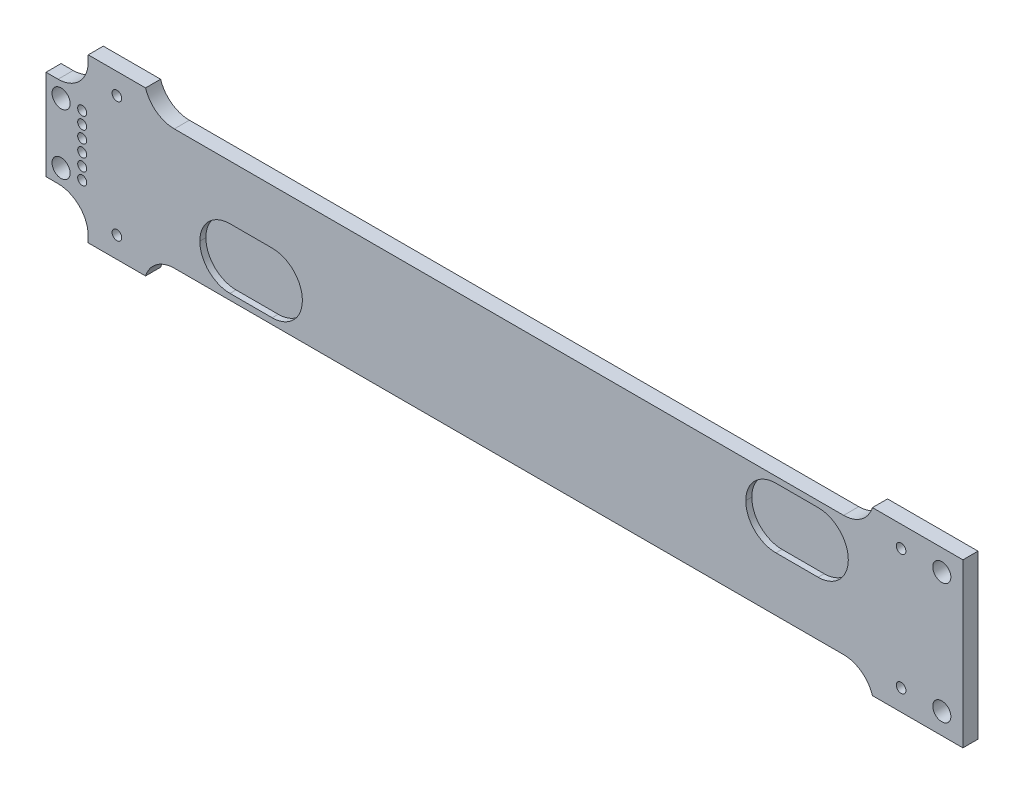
ISO-10303-21;
HEADER;
FILE_DESCRIPTION(('STEP AP214'),'2;1');
FILE_NAME('part.step','',(''),(''),'','','');
FILE_SCHEMA(('AUTOMOTIVE_DESIGN { 1 0 10303 214 1 1 1 1 }'));
ENDSEC;
DATA;
#1=APPLICATION_CONTEXT('core data for automotive mechanical design processes');
#2=APPLICATION_PROTOCOL_DEFINITION('international standard','automotive_design',2000,#1);
#3=PRODUCT_CONTEXT('',#1,'mechanical');
#4=PRODUCT('Part','Part','',(#3));
#5=PRODUCT_RELATED_PRODUCT_CATEGORY('part','',(#4));
#6=PRODUCT_DEFINITION_FORMATION('','',#4);
#7=PRODUCT_DEFINITION_CONTEXT('part definition',#1,'design');
#8=PRODUCT_DEFINITION('design','',#6,#7);
#9=PRODUCT_DEFINITION_SHAPE('','',#8);
#10=(LENGTH_UNIT() NAMED_UNIT(*) SI_UNIT(.MILLI.,.METRE.));
#11=(NAMED_UNIT(*) PLANE_ANGLE_UNIT() SI_UNIT($,.RADIAN.));
#12=(NAMED_UNIT(*) SI_UNIT($,.STERADIAN.) SOLID_ANGLE_UNIT());
#13=UNCERTAINTY_MEASURE_WITH_UNIT(LENGTH_MEASURE(1.E-05),#10,'distance_accuracy_value','');
#14=(GEOMETRIC_REPRESENTATION_CONTEXT(3) GLOBAL_UNCERTAINTY_ASSIGNED_CONTEXT((#13)) GLOBAL_UNIT_ASSIGNED_CONTEXT((#10,
#11,#12)) REPRESENTATION_CONTEXT('',''));
#15=CARTESIAN_POINT('',(0.,0.,0.));
#16=DIRECTION('',(0.,0.,1.));
#17=DIRECTION('',(1.,0.,0.));
#18=AXIS2_PLACEMENT_3D('',#15,#16,#17);
#19=CARTESIAN_POINT('',(0.,0.,-1.5));
#20=DIRECTION('',(0.,0.,-1.));
#21=DIRECTION('',(-1.,0.,0.));
#22=AXIS2_PLACEMENT_3D('',#19,#20,#21);
#23=PLANE('',#22);
#24=CARTESIAN_POINT('',(-9.99999999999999,6.49999999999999,-1.5));
#25=DIRECTION('',(0.,0.,-1.));
#26=DIRECTION('',(-1.,0.,0.));
#27=AXIS2_PLACEMENT_3D('',#24,#25,#26);
#28=CIRCLE('',#27,2.);
#29=CARTESIAN_POINT('',(-11.3228756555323,7.99999999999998,-1.5));
#30=VERTEX_POINT('',#29);
#31=CARTESIAN_POINT('',(-9.00000000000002,4.7679491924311,-1.5));
#32=VERTEX_POINT('',#31);
#33=EDGE_CURVE('E422',#30,#32,#28,.T.);
#34=ORIENTED_EDGE('',*,*,#33,.T.);
#35=DIRECTION('',(0.,-1.,0.));
#36=VECTOR('',#35,1.);
#37=CARTESIAN_POINT('',(-9.00000000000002,-8.00000000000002,-1.5));
#38=LINE('',#37,#36);
#39=CARTESIAN_POINT('',(-9.00000000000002,-4.76794919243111,-1.5));
#40=VERTEX_POINT('',#39);
#41=EDGE_CURVE('E434',#32,#40,#38,.T.);
#42=ORIENTED_EDGE('',*,*,#41,.T.);
#43=CARTESIAN_POINT('',(-9.99999999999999,-6.50000000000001,-1.5));
#44=DIRECTION('',(0.,0.,-1.));
#45=DIRECTION('',(-1.,0.,0.));
#46=AXIS2_PLACEMENT_3D('',#43,#44,#45);
#47=CIRCLE('',#46,2.);
#48=CARTESIAN_POINT('',(-11.3228756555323,-8.00000000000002,-1.5));
#49=VERTEX_POINT('',#48);
#50=EDGE_CURVE('E391',#40,#49,#47,.T.);
#51=ORIENTED_EDGE('',*,*,#50,.T.);
#52=DIRECTION('',(-1.,0.,0.));
#53=VECTOR('',#52,1.);
#54=CARTESIAN_POINT('',(-143.,-8.,-1.5));
#55=LINE('',#54,#53);
#56=CARTESIAN_POINT('',(-140.677124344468,-8.,-1.5));
#57=VERTEX_POINT('',#56);
#58=EDGE_CURVE('E437',#49,#57,#55,.T.);
#59=ORIENTED_EDGE('',*,*,#58,.T.);
#60=CARTESIAN_POINT('',(-142.,-6.50000000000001,-1.5));
#61=DIRECTION('',(0.,0.,-1.));
#62=DIRECTION('',(-1.,0.,0.));
#63=AXIS2_PLACEMENT_3D('',#60,#61,#62);
#64=CIRCLE('',#63,2.);
#65=CARTESIAN_POINT('',(-143.,-4.76794919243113,-1.5));
#66=VERTEX_POINT('',#65);
#67=EDGE_CURVE('E401',#57,#66,#64,.T.);
#68=ORIENTED_EDGE('',*,*,#67,.T.);
#69=DIRECTION('',(0.,1.,0.));
#70=VECTOR('',#69,1.);
#71=CARTESIAN_POINT('',(-143.,-8.,-1.5));
#72=LINE('',#71,#70);
#73=CARTESIAN_POINT('',(-143.,4.76794919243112,-1.5));
#74=VERTEX_POINT('',#73);
#75=EDGE_CURVE('E441',#66,#74,#72,.T.);
#76=ORIENTED_EDGE('',*,*,#75,.T.);
#77=CARTESIAN_POINT('',(-142.,6.49999999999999,-1.5));
#78=DIRECTION('',(0.,0.,-1.));
#79=DIRECTION('',(-1.,0.,0.));
#80=AXIS2_PLACEMENT_3D('',#77,#78,#79);
#81=CIRCLE('',#80,2.);
#82=CARTESIAN_POINT('',(-140.677124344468,8.00000000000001,-1.5));
#83=VERTEX_POINT('',#82);
#84=EDGE_CURVE('E396',#74,#83,#81,.T.);
#85=ORIENTED_EDGE('',*,*,#84,.T.);
#86=DIRECTION('',(1.,0.,0.));
#87=VECTOR('',#86,1.);
#88=CARTESIAN_POINT('',(-143.,8.,-1.5));
#89=LINE('',#88,#87);
#90=EDGE_CURVE('E444',#83,#30,#89,.T.);
#91=ORIENTED_EDGE('',*,*,#90,.T.);
#92=EDGE_LOOP('',(#34,#42,#51,#59,#68,#76,#85,#91));
#93=FACE_BOUND('',#92,.T.);
#94=ADVANCED_FACE('F37',(#93),#23,.T.);
#95=CARTESIAN_POINT('',(-135.5,13.5,-2.5));
#96=DIRECTION('',(0.,1.,0.));
#97=DIRECTION('',(-1.,0.,0.));
#98=AXIS2_PLACEMENT_3D('',#95,#96,#97);
#99=PLANE('',#98);
#100=DIRECTION('',(0.,0.,-1.));
#101=VECTOR('',#100,1.);
#102=CARTESIAN_POINT('',(-145.,13.5,131.5));
#103=LINE('',#102,#101);
#104=CARTESIAN_POINT('',(-145.,13.5,0.));
#105=VERTEX_POINT('',#104);
#106=CARTESIAN_POINT('',(-145.,13.5,-2.5));
#107=VERTEX_POINT('',#106);
#108=EDGE_CURVE('E334',#105,#107,#103,.T.);
#109=ORIENTED_EDGE('',*,*,#108,.F.);
#110=DIRECTION('',(-1.,0.,0.));
#111=VECTOR('',#110,1.);
#112=CARTESIAN_POINT('',(-135.5,13.5,0.));
#113=LINE('',#112,#111);
#114=CARTESIAN_POINT('',(-135.5,13.5,0.));
#115=VERTEX_POINT('',#114);
#116=EDGE_CURVE('E457',#115,#105,#113,.T.);
#117=ORIENTED_EDGE('',*,*,#116,.F.);
#118=DIRECTION('',(0.,0.,1.));
#119=VECTOR('',#118,1.);
#120=CARTESIAN_POINT('',(-135.5,13.5,-2.5));
#121=LINE('',#120,#119);
#122=CARTESIAN_POINT('',(-135.5,13.5,-2.5));
#123=VERTEX_POINT('',#122);
#124=EDGE_CURVE('E521',#123,#115,#121,.T.);
#125=ORIENTED_EDGE('',*,*,#124,.F.);
#126=DIRECTION('',(-1.,0.,0.));
#127=VECTOR('',#126,1.);
#128=CARTESIAN_POINT('',(-135.5,13.5,-2.5));
#129=LINE('',#128,#127);
#130=EDGE_CURVE('E458',#123,#107,#129,.T.);
#131=ORIENTED_EDGE('',*,*,#130,.T.);
#132=EDGE_LOOP('',(#109,#117,#125,#131));
#133=FACE_BOUND('',#132,.T.);
#134=ADVANCED_FACE('F663',(#133),#99,.T.);
#135=CARTESIAN_POINT('',(-130.730303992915,15.,-2.5));
#136=DIRECTION('',(0.,0.,1.));
#137=DIRECTION('',(1.,0.,0.));
#138=AXIS2_PLACEMENT_3D('',#135,#136,#137);
#139=CYLINDRICAL_SURFACE('',#138,5.00000000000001);
#140=CARTESIAN_POINT('',(-130.730303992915,15.,0.));
#141=DIRECTION('',(0.,0.,-1.));
#142=DIRECTION('',(-1.,0.,0.));
#143=AXIS2_PLACEMENT_3D('',#140,#141,#142);
#144=CIRCLE('',#143,5.00000000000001);
#145=CARTESIAN_POINT('',(-130.730303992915,9.99999999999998,0.));
#146=VERTEX_POINT('',#145);
#147=EDGE_CURVE('E462',#146,#115,#144,.T.);
#148=ORIENTED_EDGE('',*,*,#147,.F.);
#149=DIRECTION('',(0.,0.,1.));
#150=VECTOR('',#149,1.);
#151=CARTESIAN_POINT('',(-130.730303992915,9.99999999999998,-2.5));
#152=LINE('',#151,#150);
#153=CARTESIAN_POINT('',(-130.730303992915,9.99999999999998,-2.5));
#154=VERTEX_POINT('',#153);
#155=EDGE_CURVE('E523',#154,#146,#152,.T.);
#156=ORIENTED_EDGE('',*,*,#155,.F.);
#157=CARTESIAN_POINT('',(-130.730303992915,15.,-2.5));
#158=DIRECTION('',(0.,0.,-1.));
#159=DIRECTION('',(-1.,0.,0.));
#160=AXIS2_PLACEMENT_3D('',#157,#158,#159);
#161=CIRCLE('',#160,5.00000000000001);
#162=EDGE_CURVE('E487',#154,#123,#161,.T.);
#163=ORIENTED_EDGE('',*,*,#162,.T.);
#164=ORIENTED_EDGE('',*,*,#124,.T.);
#165=EDGE_LOOP('',(#148,#156,#163,#164));
#166=FACE_BOUND('',#165,.T.);
#167=ADVANCED_FACE('F668',(#166),#139,.F.);
#168=CARTESIAN_POINT('',(-130.730303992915,9.99999999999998,-2.5));
#169=DIRECTION('',(0.,1.,0.));
#170=DIRECTION('',(-1.,0.,0.));
#171=AXIS2_PLACEMENT_3D('',#168,#169,#170);
#172=PLANE('',#171);
#173=DIRECTION('',(-1.,0.,0.));
#174=VECTOR('',#173,1.);
#175=CARTESIAN_POINT('',(-130.730303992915,9.99999999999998,0.));
#176=LINE('',#175,#174);
#177=CARTESIAN_POINT('',(-19.7696960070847,9.99999999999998,0.));
#178=VERTEX_POINT('',#177);
#179=EDGE_CURVE('E516',#178,#146,#176,.T.);
#180=ORIENTED_EDGE('',*,*,#179,.F.);
#181=DIRECTION('',(0.,0.,1.));
#182=VECTOR('',#181,1.);
#183=CARTESIAN_POINT('',(-19.7696960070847,9.99999999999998,-2.5));
#184=LINE('',#183,#182);
#185=CARTESIAN_POINT('',(-19.7696960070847,9.99999999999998,-2.5));
#186=VERTEX_POINT('',#185);
#187=EDGE_CURVE('E525',#186,#178,#184,.T.);
#188=ORIENTED_EDGE('',*,*,#187,.F.);
#189=DIRECTION('',(-1.,0.,0.));
#190=VECTOR('',#189,1.);
#191=CARTESIAN_POINT('',(-130.730303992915,9.99999999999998,-2.5));
#192=LINE('',#191,#190);
#193=EDGE_CURVE('E484',#186,#154,#192,.T.);
#194=ORIENTED_EDGE('',*,*,#193,.T.);
#195=ORIENTED_EDGE('',*,*,#155,.T.);
#196=EDGE_LOOP('',(#180,#188,#194,#195));
#197=FACE_BOUND('',#196,.T.);
#198=ADVANCED_FACE('F701',(#197),#172,.T.);
#199=CARTESIAN_POINT('',(-19.7696960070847,15.,-2.5));
#200=DIRECTION('',(0.,0.,1.));
#201=DIRECTION('',(1.,0.,0.));
#202=AXIS2_PLACEMENT_3D('',#199,#200,#201);
#203=CYLINDRICAL_SURFACE('',#202,5.00000000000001);
#204=CARTESIAN_POINT('',(-19.7696960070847,15.,0.));
#205=DIRECTION('',(0.,0.,-1.));
#206=DIRECTION('',(1.,0.,0.));
#207=AXIS2_PLACEMENT_3D('',#204,#205,#206);
#208=CIRCLE('',#207,5.00000000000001);
#209=CARTESIAN_POINT('',(-15.,13.5,0.));
#210=VERTEX_POINT('',#209);
#211=EDGE_CURVE('E513',#210,#178,#208,.T.);
#212=ORIENTED_EDGE('',*,*,#211,.F.);
#213=DIRECTION('',(0.,0.,1.));
#214=VECTOR('',#213,1.);
#215=CARTESIAN_POINT('',(-15.,13.5,-2.5));
#216=LINE('',#215,#214);
#217=CARTESIAN_POINT('',(-15.,13.5,-2.5));
#218=VERTEX_POINT('',#217);
#219=EDGE_CURVE('E527',#218,#210,#216,.T.);
#220=ORIENTED_EDGE('',*,*,#219,.F.);
#221=CARTESIAN_POINT('',(-19.7696960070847,15.,-2.5));
#222=DIRECTION('',(0.,0.,-1.));
#223=DIRECTION('',(1.,0.,0.));
#224=AXIS2_PLACEMENT_3D('',#221,#222,#223);
#225=CIRCLE('',#224,5.00000000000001);
#226=EDGE_CURVE('E481',#218,#186,#225,.T.);
#227=ORIENTED_EDGE('',*,*,#226,.T.);
#228=ORIENTED_EDGE('',*,*,#187,.T.);
#229=EDGE_LOOP('',(#212,#220,#227,#228));
#230=FACE_BOUND('',#229,.T.);
#231=ADVANCED_FACE('F705',(#230),#203,.F.);
#232=CARTESIAN_POINT('',(0.,13.5,-2.5));
#233=DIRECTION('',(0.,1.,0.));
#234=DIRECTION('',(-1.,0.,0.));
#235=AXIS2_PLACEMENT_3D('',#232,#233,#234);
#236=PLANE('',#235);
#237=DIRECTION('',(-1.,0.,0.));
#238=VECTOR('',#237,1.);
#239=CARTESIAN_POINT('',(0.,13.5,0.));
#240=LINE('',#239,#238);
#241=CARTESIAN_POINT('',(0.,13.5,0.));
#242=VERTEX_POINT('',#241);
#243=EDGE_CURVE('E510',#242,#210,#240,.T.);
#244=ORIENTED_EDGE('',*,*,#243,.F.);
#245=DIRECTION('',(0.,0.,1.));
#246=VECTOR('',#245,1.);
#247=CARTESIAN_POINT('',(0.,13.5,-2.5));
#248=LINE('',#247,#246);
#249=CARTESIAN_POINT('',(0.,13.5,-2.5));
#250=VERTEX_POINT('',#249);
#251=EDGE_CURVE('E529',#250,#242,#248,.T.);
#252=ORIENTED_EDGE('',*,*,#251,.F.);
#253=DIRECTION('',(-1.,0.,0.));
#254=VECTOR('',#253,1.);
#255=CARTESIAN_POINT('',(0.,13.5,-2.5));
#256=LINE('',#255,#254);
#257=EDGE_CURVE('E478',#250,#218,#256,.T.);
#258=ORIENTED_EDGE('',*,*,#257,.T.);
#259=ORIENTED_EDGE('',*,*,#219,.T.);
#260=EDGE_LOOP('',(#244,#252,#258,#259));
#261=FACE_BOUND('',#260,.T.);
#262=ADVANCED_FACE('F709',(#261),#236,.T.);
#263=CARTESIAN_POINT('',(0.,13.5,-2.5));
#264=DIRECTION('',(1.,0.,0.));
#265=DIRECTION('',(0.,1.,0.));
#266=AXIS2_PLACEMENT_3D('',#263,#264,#265);
#267=PLANE('',#266);
#268=DIRECTION('',(0.,1.,0.));
#269=VECTOR('',#268,1.);
#270=CARTESIAN_POINT('',(0.,13.5,-2.5));
#271=LINE('',#270,#269);
#272=CARTESIAN_POINT('',(0.,-13.5,-2.5));
#273=VERTEX_POINT('',#272);
#274=EDGE_CURVE('E476',#273,#250,#271,.T.);
#275=ORIENTED_EDGE('',*,*,#274,.T.);
#276=ORIENTED_EDGE('',*,*,#251,.T.);
#277=DIRECTION('',(0.,1.,0.));
#278=VECTOR('',#277,1.);
#279=CARTESIAN_POINT('',(0.,13.5,0.));
#280=LINE('',#279,#278);
#281=CARTESIAN_POINT('',(0.,-13.5,0.));
#282=VERTEX_POINT('',#281);
#283=EDGE_CURVE('E507',#282,#242,#280,.T.);
#284=ORIENTED_EDGE('',*,*,#283,.F.);
#285=DIRECTION('',(0.,0.,1.));
#286=VECTOR('',#285,1.);
#287=CARTESIAN_POINT('',(0.,-13.5,-2.5));
#288=LINE('',#287,#286);
#289=EDGE_CURVE('E531',#273,#282,#288,.T.);
#290=ORIENTED_EDGE('',*,*,#289,.F.);
#291=EDGE_LOOP('',(#275,#276,#284,#290));
#292=FACE_BOUND('',#291,.T.);
#293=ADVANCED_FACE('F713',(#292),#267,.T.);
#294=CARTESIAN_POINT('',(0.,-13.5,-2.5));
#295=DIRECTION('',(0.,-1.,0.));
#296=DIRECTION('',(1.,0.,0.));
#297=AXIS2_PLACEMENT_3D('',#294,#295,#296);
#298=PLANE('',#297);
#299=DIRECTION('',(1.,0.,0.));
#300=VECTOR('',#299,1.);
#301=CARTESIAN_POINT('',(0.,-13.5,0.));
#302=LINE('',#301,#300);
#303=CARTESIAN_POINT('',(-15.,-13.5,0.));
#304=VERTEX_POINT('',#303);
#305=EDGE_CURVE('E504',#304,#282,#302,.T.);
#306=ORIENTED_EDGE('',*,*,#305,.F.);
#307=DIRECTION('',(0.,0.,1.));
#308=VECTOR('',#307,1.);
#309=CARTESIAN_POINT('',(-15.,-13.5,-2.5));
#310=LINE('',#309,#308);
#311=CARTESIAN_POINT('',(-15.,-13.5,-2.5));
#312=VERTEX_POINT('',#311);
#313=EDGE_CURVE('E533',#312,#304,#310,.T.);
#314=ORIENTED_EDGE('',*,*,#313,.F.);
#315=DIRECTION('',(1.,0.,0.));
#316=VECTOR('',#315,1.);
#317=CARTESIAN_POINT('',(0.,-13.5,-2.5));
#318=LINE('',#317,#316);
#319=EDGE_CURVE('E473',#312,#273,#318,.T.);
#320=ORIENTED_EDGE('',*,*,#319,.T.);
#321=ORIENTED_EDGE('',*,*,#289,.T.);
#322=EDGE_LOOP('',(#306,#314,#320,#321));
#323=FACE_BOUND('',#322,.T.);
#324=ADVANCED_FACE('F717',(#323),#298,.T.);
#325=CARTESIAN_POINT('',(-19.7696960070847,-15.,-2.5));
#326=DIRECTION('',(0.,0.,1.));
#327=DIRECTION('',(1.,0.,0.));
#328=AXIS2_PLACEMENT_3D('',#325,#326,#327);
#329=CYLINDRICAL_SURFACE('',#328,5.00000000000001);
#330=CARTESIAN_POINT('',(-19.7696960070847,-15.,0.));
#331=DIRECTION('',(0.,0.,-1.));
#332=DIRECTION('',(1.,0.,0.));
#333=AXIS2_PLACEMENT_3D('',#330,#331,#332);
#334=CIRCLE('',#333,5.00000000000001);
#335=CARTESIAN_POINT('',(-19.7696960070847,-9.99999999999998,0.));
#336=VERTEX_POINT('',#335);
#337=EDGE_CURVE('E501',#336,#304,#334,.T.);
#338=ORIENTED_EDGE('',*,*,#337,.F.);
#339=DIRECTION('',(0.,0.,1.));
#340=VECTOR('',#339,1.);
#341=CARTESIAN_POINT('',(-19.7696960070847,-9.99999999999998,-2.5));
#342=LINE('',#341,#340);
#343=CARTESIAN_POINT('',(-19.7696960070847,-9.99999999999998,-2.5));
#344=VERTEX_POINT('',#343);
#345=EDGE_CURVE('E535',#344,#336,#342,.T.);
#346=ORIENTED_EDGE('',*,*,#345,.F.);
#347=CARTESIAN_POINT('',(-19.7696960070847,-15.,-2.5));
#348=DIRECTION('',(0.,0.,-1.));
#349=DIRECTION('',(1.,0.,0.));
#350=AXIS2_PLACEMENT_3D('',#347,#348,#349);
#351=CIRCLE('',#350,5.00000000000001);
#352=EDGE_CURVE('E470',#344,#312,#351,.T.);
#353=ORIENTED_EDGE('',*,*,#352,.T.);
#354=ORIENTED_EDGE('',*,*,#313,.T.);
#355=EDGE_LOOP('',(#338,#346,#353,#354));
#356=FACE_BOUND('',#355,.T.);
#357=ADVANCED_FACE('F721',(#356),#329,.F.);
#358=CARTESIAN_POINT('',(-19.7696960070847,-9.99999999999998,-2.5));
#359=DIRECTION('',(0.,-1.,0.));
#360=DIRECTION('',(1.,0.,0.));
#361=AXIS2_PLACEMENT_3D('',#358,#359,#360);
#362=PLANE('',#361);
#363=DIRECTION('',(1.,0.,0.));
#364=VECTOR('',#363,1.);
#365=CARTESIAN_POINT('',(-19.7696960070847,-9.99999999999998,0.));
#366=LINE('',#365,#364);
#367=CARTESIAN_POINT('',(-130.730303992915,-10.,0.));
#368=VERTEX_POINT('',#367);
#369=EDGE_CURVE('E498',#368,#336,#366,.T.);
#370=ORIENTED_EDGE('',*,*,#369,.F.);
#371=DIRECTION('',(0.,0.,1.));
#372=VECTOR('',#371,1.);
#373=CARTESIAN_POINT('',(-130.730303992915,-10.,-2.5));
#374=LINE('',#373,#372);
#375=CARTESIAN_POINT('',(-130.730303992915,-10.,-2.5));
#376=VERTEX_POINT('',#375);
#377=EDGE_CURVE('E537',#376,#368,#374,.T.);
#378=ORIENTED_EDGE('',*,*,#377,.F.);
#379=DIRECTION('',(1.,0.,0.));
#380=VECTOR('',#379,1.);
#381=CARTESIAN_POINT('',(-19.7696960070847,-9.99999999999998,-2.5));
#382=LINE('',#381,#380);
#383=EDGE_CURVE('E467',#376,#344,#382,.T.);
#384=ORIENTED_EDGE('',*,*,#383,.T.);
#385=ORIENTED_EDGE('',*,*,#345,.T.);
#386=EDGE_LOOP('',(#370,#378,#384,#385));
#387=FACE_BOUND('',#386,.T.);
#388=ADVANCED_FACE('F725',(#387),#362,.T.);
#389=CARTESIAN_POINT('',(-130.730303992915,-15.,-2.5));
#390=DIRECTION('',(0.,0.,1.));
#391=DIRECTION('',(1.,0.,0.));
#392=AXIS2_PLACEMENT_3D('',#389,#390,#391);
#393=CYLINDRICAL_SURFACE('',#392,5.00000000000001);
#394=CARTESIAN_POINT('',(-130.730303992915,-15.,0.));
#395=DIRECTION('',(0.,0.,-1.));
#396=DIRECTION('',(1.,0.,0.));
#397=AXIS2_PLACEMENT_3D('',#394,#395,#396);
#398=CIRCLE('',#397,5.00000000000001);
#399=CARTESIAN_POINT('',(-135.5,-13.5,0.));
#400=VERTEX_POINT('',#399);
#401=EDGE_CURVE('E495',#400,#368,#398,.T.);
#402=ORIENTED_EDGE('',*,*,#401,.F.);
#403=DIRECTION('',(0.,0.,1.));
#404=VECTOR('',#403,1.);
#405=CARTESIAN_POINT('',(-135.5,-13.5,-2.5));
#406=LINE('',#405,#404);
#407=CARTESIAN_POINT('',(-135.5,-13.5,-2.5));
#408=VERTEX_POINT('',#407);
#409=EDGE_CURVE('E490',#408,#400,#406,.T.);
#410=ORIENTED_EDGE('',*,*,#409,.F.);
#411=CARTESIAN_POINT('',(-130.730303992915,-15.,-2.5));
#412=DIRECTION('',(0.,0.,-1.));
#413=DIRECTION('',(1.,0.,0.));
#414=AXIS2_PLACEMENT_3D('',#411,#412,#413);
#415=CIRCLE('',#414,5.00000000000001);
#416=EDGE_CURVE('E464',#408,#376,#415,.T.);
#417=ORIENTED_EDGE('',*,*,#416,.T.);
#418=ORIENTED_EDGE('',*,*,#377,.T.);
#419=EDGE_LOOP('',(#402,#410,#417,#418));
#420=FACE_BOUND('',#419,.T.);
#421=ADVANCED_FACE('F729',(#420),#393,.F.);
#422=CARTESIAN_POINT('',(-150.,-13.5,-2.5));
#423=DIRECTION('',(0.,-1.,0.));
#424=DIRECTION('',(1.,0.,0.));
#425=AXIS2_PLACEMENT_3D('',#422,#423,#424);
#426=PLANE('',#425);
#427=DIRECTION('',(0.,0.,-1.));
#428=VECTOR('',#427,1.);
#429=CARTESIAN_POINT('',(-145.,-13.5,131.5));
#430=LINE('',#429,#428);
#431=CARTESIAN_POINT('',(-145.,-13.5,0.));
#432=VERTEX_POINT('',#431);
#433=CARTESIAN_POINT('',(-145.,-13.5,-2.5));
#434=VERTEX_POINT('',#433);
#435=EDGE_CURVE('E324',#432,#434,#430,.T.);
#436=ORIENTED_EDGE('',*,*,#435,.T.);
#437=DIRECTION('',(1.,0.,0.));
#438=VECTOR('',#437,1.);
#439=CARTESIAN_POINT('',(-150.,-13.5,-2.5));
#440=LINE('',#439,#438);
#441=EDGE_CURVE('E461',#434,#408,#440,.T.);
#442=ORIENTED_EDGE('',*,*,#441,.T.);
#443=ORIENTED_EDGE('',*,*,#409,.T.);
#444=DIRECTION('',(1.,0.,0.));
#445=VECTOR('',#444,1.);
#446=CARTESIAN_POINT('',(-150.,-13.5,0.));
#447=LINE('',#446,#445);
#448=EDGE_CURVE('E493',#432,#400,#447,.T.);
#449=ORIENTED_EDGE('',*,*,#448,.F.);
#450=EDGE_LOOP('',(#436,#442,#443,#449));
#451=FACE_BOUND('',#450,.T.);
#452=ADVANCED_FACE('F694',(#451),#426,.T.);
#453=CARTESIAN_POINT('',(-130.730303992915,-15.,-2.5));
#454=DIRECTION('',(0.,0.,1.));
#455=DIRECTION('',(1.,0.,0.));
#456=AXIS2_PLACEMENT_3D('',#453,#454,#455);
#457=PLANE('',#456);
#458=CARTESIAN_POINT('',(-140.25,9.99999999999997,-2.5));
#459=DIRECTION('',(0.,0.,1.));
#460=DIRECTION('',(1.,0.,0.));
#461=AXIS2_PLACEMENT_3D('',#458,#459,#460);
#462=CIRCLE('',#461,0.799999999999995);
#463=CARTESIAN_POINT('',(-139.45,9.99999999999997,-2.5));
#464=VERTEX_POINT('',#463);
#465=EDGE_CURVE('E817',#464,#464,#462,.T.);
#466=ORIENTED_EDGE('',*,*,#465,.T.);
#467=EDGE_LOOP('',(#466));
#468=FACE_BOUND('',#467,.T.);
#469=CARTESIAN_POINT('',(-140.25,-9.99999999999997,-2.5));
#470=DIRECTION('',(0.,0.,1.));
#471=DIRECTION('',(1.,0.,0.));
#472=AXIS2_PLACEMENT_3D('',#469,#470,#471);
#473=CIRCLE('',#472,0.799999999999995);
#474=CARTESIAN_POINT('',(-139.45,-9.99999999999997,-2.5));
#475=VERTEX_POINT('',#474);
#476=EDGE_CURVE('E811',#475,#475,#473,.T.);
#477=ORIENTED_EDGE('',*,*,#476,.T.);
#478=EDGE_LOOP('',(#477));
#479=FACE_BOUND('',#478,.T.);
#480=CARTESIAN_POINT('',(-142.,6.49999999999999,-2.5));
#481=DIRECTION('',(0.,0.,-1.));
#482=DIRECTION('',(-1.,0.,0.));
#483=AXIS2_PLACEMENT_3D('',#480,#481,#482);
#484=CIRCLE('',#483,2.);
#485=CARTESIAN_POINT('',(-143.7,5.4464346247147,-2.5));
#486=VERTEX_POINT('',#485);
#487=CARTESIAN_POINT('',(-140.677124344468,8.,-2.5));
#488=VERTEX_POINT('',#487);
#489=EDGE_CURVE('E399',#486,#488,#484,.T.);
#490=ORIENTED_EDGE('',*,*,#489,.F.);
#491=DIRECTION('',(0.,-1.,0.));
#492=VECTOR('',#491,1.);
#493=CARTESIAN_POINT('',(-143.7,-15.,-2.5));
#494=LINE('',#493,#492);
#495=CARTESIAN_POINT('',(-143.7,-5.44643462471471,-2.5));
#496=VERTEX_POINT('',#495);
#497=EDGE_CURVE('E45',#486,#496,#494,.T.);
#498=ORIENTED_EDGE('',*,*,#497,.T.);
#499=CARTESIAN_POINT('',(-142.,-6.50000000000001,-2.5));
#500=DIRECTION('',(0.,0.,-1.));
#501=DIRECTION('',(-1.,0.,0.));
#502=AXIS2_PLACEMENT_3D('',#499,#500,#501);
#503=CIRCLE('',#502,2.);
#504=CARTESIAN_POINT('',(-140.677124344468,-8.,-2.5));
#505=VERTEX_POINT('',#504);
#506=EDGE_CURVE('E388',#505,#496,#503,.T.);
#507=ORIENTED_EDGE('',*,*,#506,.F.);
#508=DIRECTION('',(-1.,0.,0.));
#509=VECTOR('',#508,1.);
#510=CARTESIAN_POINT('',(-143.,-8.,-2.5));
#511=LINE('',#510,#509);
#512=CARTESIAN_POINT('',(-11.3228756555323,-8.00000000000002,-2.5));
#513=VERTEX_POINT('',#512);
#514=EDGE_CURVE('E449',#513,#505,#511,.T.);
#515=ORIENTED_EDGE('',*,*,#514,.F.);
#516=CARTESIAN_POINT('',(-9.99999999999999,-6.50000000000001,-2.5));
#517=DIRECTION('',(0.,0.,-1.));
#518=DIRECTION('',(-1.,0.,0.));
#519=AXIS2_PLACEMENT_3D('',#516,#517,#518);
#520=CIRCLE('',#519,2.);
#521=CARTESIAN_POINT('',(-9.00000000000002,-4.76794919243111,-2.5));
#522=VERTEX_POINT('',#521);
#523=EDGE_CURVE('E394',#522,#513,#520,.T.);
#524=ORIENTED_EDGE('',*,*,#523,.F.);
#525=DIRECTION('',(0.,-1.,0.));
#526=VECTOR('',#525,1.);
#527=CARTESIAN_POINT('',(-9.00000000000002,-8.00000000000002,-2.5));
#528=LINE('',#527,#526);
#529=CARTESIAN_POINT('',(-9.00000000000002,4.7679491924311,-2.5));
#530=VERTEX_POINT('',#529);
#531=EDGE_CURVE('E433',#530,#522,#528,.T.);
#532=ORIENTED_EDGE('',*,*,#531,.F.);
#533=CARTESIAN_POINT('',(-9.99999999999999,6.49999999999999,-2.5));
#534=DIRECTION('',(0.,0.,-1.));
#535=DIRECTION('',(-1.,0.,0.));
#536=AXIS2_PLACEMENT_3D('',#533,#534,#535);
#537=CIRCLE('',#536,2.);
#538=CARTESIAN_POINT('',(-11.3228756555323,7.99999999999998,-2.5));
#539=VERTEX_POINT('',#538);
#540=EDGE_CURVE('E421',#539,#530,#537,.T.);
#541=ORIENTED_EDGE('',*,*,#540,.F.);
#542=DIRECTION('',(1.,0.,0.));
#543=VECTOR('',#542,1.);
#544=CARTESIAN_POINT('',(-143.,8.,-2.5));
#545=LINE('',#544,#543);
#546=EDGE_CURVE('E438',#488,#539,#545,.T.);
#547=ORIENTED_EDGE('',*,*,#546,.F.);
#548=EDGE_LOOP('',(#490,#498,#507,#515,#524,#532,#541,#547));
#549=FACE_BOUND('',#548,.T.);
#550=CARTESIAN_POINT('',(-10.25,9.99999999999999,-2.5));
#551=DIRECTION('',(0.,0.,1.));
#552=DIRECTION('',(1.,0.,0.));
#553=AXIS2_PLACEMENT_3D('',#550,#551,#552);
#554=CIRCLE('',#553,0.8);
#555=CARTESIAN_POINT('',(-9.45,9.99999999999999,-2.5));
#556=VERTEX_POINT('',#555);
#557=EDGE_CURVE('E805',#556,#556,#554,.T.);
#558=ORIENTED_EDGE('',*,*,#557,.T.);
#559=EDGE_LOOP('',(#558));
#560=FACE_BOUND('',#559,.T.);
#561=CARTESIAN_POINT('',(-10.25,-10.,-2.5));
#562=DIRECTION('',(0.,0.,1.));
#563=DIRECTION('',(1.,0.,0.));
#564=AXIS2_PLACEMENT_3D('',#561,#562,#563);
#565=CIRCLE('',#564,0.8);
#566=CARTESIAN_POINT('',(-9.45,-10.,-2.5));
#567=VERTEX_POINT('',#566);
#568=EDGE_CURVE('E632',#567,#567,#565,.T.);
#569=ORIENTED_EDGE('',*,*,#568,.T.);
#570=EDGE_LOOP('',(#569));
#571=FACE_BOUND('',#570,.T.);
#572=CARTESIAN_POINT('',(-146.,-3.,-2.5));
#573=DIRECTION('',(0.,0.,-1.));
#574=DIRECTION('',(-1.,0.,0.));
#575=AXIS2_PLACEMENT_3D('',#572,#573,#574);
#576=CIRCLE('',#575,0.750000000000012);
#577=CARTESIAN_POINT('',(-146.75,-3.,-2.5));
#578=VERTEX_POINT('',#577);
#579=EDGE_CURVE('E342',#578,#578,#576,.T.);
#580=ORIENTED_EDGE('',*,*,#579,.F.);
#581=EDGE_LOOP('',(#580));
#582=FACE_BOUND('',#581,.T.);
#583=CARTESIAN_POINT('',(-146.,-1.,-2.5));
#584=DIRECTION('',(0.,0.,-1.));
#585=DIRECTION('',(-1.,0.,0.));
#586=AXIS2_PLACEMENT_3D('',#583,#584,#585);
#587=CIRCLE('',#586,0.750000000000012);
#588=CARTESIAN_POINT('',(-146.75,-1.,-2.5));
#589=VERTEX_POINT('',#588);
#590=EDGE_CURVE('E346',#589,#589,#587,.T.);
#591=ORIENTED_EDGE('',*,*,#590,.F.);
#592=EDGE_LOOP('',(#591));
#593=FACE_BOUND('',#592,.T.);
#594=CARTESIAN_POINT('',(-146.,1.,-2.5));
#595=DIRECTION('',(0.,0.,-1.));
#596=DIRECTION('',(-1.,0.,0.));
#597=AXIS2_PLACEMENT_3D('',#594,#595,#596);
#598=CIRCLE('',#597,0.750000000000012);
#599=CARTESIAN_POINT('',(-146.75,1.,-2.5));
#600=VERTEX_POINT('',#599);
#601=EDGE_CURVE('E349',#600,#600,#598,.T.);
#602=ORIENTED_EDGE('',*,*,#601,.F.);
#603=EDGE_LOOP('',(#602));
#604=FACE_BOUND('',#603,.T.);
#605=CARTESIAN_POINT('',(-146.,3.,-2.5));
#606=DIRECTION('',(0.,0.,-1.));
#607=DIRECTION('',(-1.,0.,0.));
#608=AXIS2_PLACEMENT_3D('',#605,#606,#607);
#609=CIRCLE('',#608,0.750000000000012);
#610=CARTESIAN_POINT('',(-146.75,3.,-2.5));
#611=VERTEX_POINT('',#610);
#612=EDGE_CURVE('E352',#611,#611,#609,.T.);
#613=ORIENTED_EDGE('',*,*,#612,.F.);
#614=EDGE_LOOP('',(#613));
#615=FACE_BOUND('',#614,.T.);
#616=CARTESIAN_POINT('',(-146.,5.,-2.5));
#617=DIRECTION('',(0.,0.,-1.));
#618=DIRECTION('',(-1.,0.,0.));
#619=AXIS2_PLACEMENT_3D('',#616,#617,#618);
#620=CIRCLE('',#619,0.750000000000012);
#621=CARTESIAN_POINT('',(-146.75,5.,-2.5));
#622=VERTEX_POINT('',#621);
#623=EDGE_CURVE('E338',#622,#622,#620,.T.);
#624=ORIENTED_EDGE('',*,*,#623,.F.);
#625=EDGE_LOOP('',(#624));
#626=FACE_BOUND('',#625,.T.);
#627=CARTESIAN_POINT('',(-146.,-5.,-2.5));
#628=DIRECTION('',(0.,0.,-1.));
#629=DIRECTION('',(-1.,0.,0.));
#630=AXIS2_PLACEMENT_3D('',#627,#628,#629);
#631=CIRCLE('',#630,0.750000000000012);
#632=CARTESIAN_POINT('',(-146.75,-5.,-2.5));
#633=VERTEX_POINT('',#632);
#634=EDGE_CURVE('E357',#633,#633,#631,.T.);
#635=ORIENTED_EDGE('',*,*,#634,.F.);
#636=EDGE_LOOP('',(#635));
#637=FACE_BOUND('',#636,.T.);
#638=CARTESIAN_POINT('',(-149.5,4.99999999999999,-2.5));
#639=DIRECTION('',(0.,0.,1.));
#640=DIRECTION('',(1.,0.,0.));
#641=AXIS2_PLACEMENT_3D('',#638,#639,#640);
#642=CIRCLE('',#641,1.5);
#643=CARTESIAN_POINT('',(-148.,4.99999999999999,-2.5));
#644=VERTEX_POINT('',#643);
#645=EDGE_CURVE('E367',#644,#644,#642,.T.);
#646=ORIENTED_EDGE('',*,*,#645,.T.);
#647=EDGE_LOOP('',(#646));
#648=FACE_BOUND('',#647,.T.);
#649=CARTESIAN_POINT('',(-3.5,9.99999999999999,-2.5));
#650=DIRECTION('',(0.,0.,1.));
#651=DIRECTION('',(1.,0.,0.));
#652=AXIS2_PLACEMENT_3D('',#649,#650,#651);
#653=CIRCLE('',#652,1.5);
#654=CARTESIAN_POINT('',(-2.,9.99999999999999,-2.5));
#655=VERTEX_POINT('',#654);
#656=EDGE_CURVE('E374',#655,#655,#653,.T.);
#657=ORIENTED_EDGE('',*,*,#656,.T.);
#658=EDGE_LOOP('',(#657));
#659=FACE_BOUND('',#658,.T.);
#660=CARTESIAN_POINT('',(-3.5,-10.,-2.5));
#661=DIRECTION('',(0.,0.,1.));
#662=DIRECTION('',(-1.,0.,0.));
#663=AXIS2_PLACEMENT_3D('',#660,#661,#662);
#664=CIRCLE('',#663,1.5);
#665=CARTESIAN_POINT('',(-5.,-10.,-2.5));
#666=VERTEX_POINT('',#665);
#667=EDGE_CURVE('E380',#666,#666,#664,.T.);
#668=ORIENTED_EDGE('',*,*,#667,.T.);
#669=EDGE_LOOP('',(#668));
#670=FACE_BOUND('',#669,.T.);
#671=CARTESIAN_POINT('',(-149.5,-5.00000000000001,-2.5));
#672=DIRECTION('',(0.,0.,1.));
#673=DIRECTION('',(1.,0.,0.));
#674=AXIS2_PLACEMENT_3D('',#671,#672,#673);
#675=CIRCLE('',#674,1.5);
#676=CARTESIAN_POINT('',(-148.,-5.00000000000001,-2.5));
#677=VERTEX_POINT('',#676);
#678=EDGE_CURVE('E385',#677,#677,#675,.T.);
#679=ORIENTED_EDGE('',*,*,#678,.T.);
#680=EDGE_LOOP('',(#679));
#681=FACE_BOUND('',#680,.T.);
#682=ORIENTED_EDGE('',*,*,#441,.F.);
#683=DIRECTION('',(0.,-1.,0.));
#684=VECTOR('',#683,1.);
#685=CARTESIAN_POINT('',(-145.,-12.5,-2.5));
#686=LINE('',#685,#684);
#687=CARTESIAN_POINT('',(-145.,-12.5,-2.5));
#688=VERTEX_POINT('',#687);
#689=EDGE_CURVE('E310',#688,#434,#686,.T.);
#690=ORIENTED_EDGE('',*,*,#689,.F.);
#691=CARTESIAN_POINT('',(-150.,-12.5,-2.5));
#692=DIRECTION('',(0.,0.,-1.));
#693=DIRECTION('',(-1.,0.,0.));
#694=AXIS2_PLACEMENT_3D('',#691,#692,#693);
#695=CIRCLE('',#694,5.);
#696=CARTESIAN_POINT('',(-150.,-7.49999999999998,-2.5));
#697=VERTEX_POINT('',#696);
#698=EDGE_CURVE('E305',#697,#688,#695,.T.);
#699=ORIENTED_EDGE('',*,*,#698,.F.);
#700=DIRECTION('',(1.,0.,0.));
#701=VECTOR('',#700,1.);
#702=CARTESIAN_POINT('',(-152.,-7.50000000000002,-2.5));
#703=LINE('',#702,#701);
#704=CARTESIAN_POINT('',(-152.,-7.50000000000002,-2.5));
#705=VERTEX_POINT('',#704);
#706=EDGE_CURVE('E288',#705,#697,#703,.T.);
#707=ORIENTED_EDGE('',*,*,#706,.F.);
#708=DIRECTION('',(0.,-1.,0.));
#709=VECTOR('',#708,1.);
#710=CARTESIAN_POINT('',(-152.,13.5,-2.5));
#711=LINE('',#710,#709);
#712=CARTESIAN_POINT('',(-152.,7.49999999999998,-2.5));
#713=VERTEX_POINT('',#712);
#714=EDGE_CURVE('E446',#713,#705,#711,.T.);
#715=ORIENTED_EDGE('',*,*,#714,.F.);
#716=DIRECTION('',(-1.,0.,0.));
#717=VECTOR('',#716,1.);
#718=CARTESIAN_POINT('',(-152.,7.49999999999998,-2.5));
#719=LINE('',#718,#717);
#720=CARTESIAN_POINT('',(-150.,7.49999999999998,-2.5));
#721=VERTEX_POINT('',#720);
#722=EDGE_CURVE('E362',#721,#713,#719,.T.);
#723=ORIENTED_EDGE('',*,*,#722,.F.);
#724=CARTESIAN_POINT('',(-150.,12.5,-2.5));
#725=DIRECTION('',(0.,0.,-1.));
#726=DIRECTION('',(1.,0.,0.));
#727=AXIS2_PLACEMENT_3D('',#724,#725,#726);
#728=CIRCLE('',#727,5.);
#729=CARTESIAN_POINT('',(-145.,12.5,-2.5));
#730=VERTEX_POINT('',#729);
#731=EDGE_CURVE('E331',#730,#721,#728,.T.);
#732=ORIENTED_EDGE('',*,*,#731,.F.);
#733=DIRECTION('',(0.,-1.,0.));
#734=VECTOR('',#733,1.);
#735=CARTESIAN_POINT('',(-145.,12.5,-2.5));
#736=LINE('',#735,#734);
#737=EDGE_CURVE('E327',#107,#730,#736,.T.);
#738=ORIENTED_EDGE('',*,*,#737,.F.);
#739=ORIENTED_EDGE('',*,*,#130,.F.);
#740=ORIENTED_EDGE('',*,*,#162,.F.);
#741=ORIENTED_EDGE('',*,*,#193,.F.);
#742=ORIENTED_EDGE('',*,*,#226,.F.);
#743=ORIENTED_EDGE('',*,*,#257,.F.);
#744=ORIENTED_EDGE('',*,*,#274,.F.);
#745=ORIENTED_EDGE('',*,*,#319,.F.);
#746=ORIENTED_EDGE('',*,*,#352,.F.);
#747=ORIENTED_EDGE('',*,*,#383,.F.);
#748=ORIENTED_EDGE('',*,*,#416,.F.);
#749=EDGE_LOOP('',(#682,#690,#699,#707,#715,#723,#732,#738,#739,#740,#741,#742,#743,#744,#745,
#746,#747,#748));
#750=FACE_BOUND('',#749,.T.);
#751=ADVANCED_FACE('F313',(#468,#479,#549,#560,#571,#582,#593,#604,#615,#626,#637,#648,#659,
#670,#681,#750),#457,.F.);
#752=CARTESIAN_POINT('',(-130.730303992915,-15.,0.));
#753=DIRECTION('',(0.,0.,1.));
#754=DIRECTION('',(1.,0.,0.));
#755=AXIS2_PLACEMENT_3D('',#752,#753,#754);
#756=PLANE('',#755);
#757=CARTESIAN_POINT('',(-140.25,9.99999999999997,0.));
#758=DIRECTION('',(0.,0.,1.));
#759=DIRECTION('',(1.,0.,0.));
#760=AXIS2_PLACEMENT_3D('',#757,#758,#759);
#761=CIRCLE('',#760,0.799999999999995);
#762=CARTESIAN_POINT('',(-139.45,9.99999999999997,0.));
#763=VERTEX_POINT('',#762);
#764=EDGE_CURVE('E820',#763,#763,#761,.T.);
#765=ORIENTED_EDGE('',*,*,#764,.F.);
#766=EDGE_LOOP('',(#765));
#767=FACE_BOUND('',#766,.T.);
#768=CARTESIAN_POINT('',(-140.25,-9.99999999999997,0.));
#769=DIRECTION('',(0.,0.,1.));
#770=DIRECTION('',(1.,0.,0.));
#771=AXIS2_PLACEMENT_3D('',#768,#769,#770);
#772=CIRCLE('',#771,0.799999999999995);
#773=CARTESIAN_POINT('',(-139.45,-9.99999999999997,0.));
#774=VERTEX_POINT('',#773);
#775=EDGE_CURVE('E814',#774,#774,#772,.T.);
#776=ORIENTED_EDGE('',*,*,#775,.F.);
#777=EDGE_LOOP('',(#776));
#778=FACE_BOUND('',#777,.T.);
#779=CARTESIAN_POINT('',(-10.25,9.99999999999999,0.));
#780=DIRECTION('',(0.,0.,1.));
#781=DIRECTION('',(1.,0.,0.));
#782=AXIS2_PLACEMENT_3D('',#779,#780,#781);
#783=CIRCLE('',#782,0.8);
#784=CARTESIAN_POINT('',(-9.45,9.99999999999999,0.));
#785=VERTEX_POINT('',#784);
#786=EDGE_CURVE('E808',#785,#785,#783,.T.);
#787=ORIENTED_EDGE('',*,*,#786,.F.);
#788=EDGE_LOOP('',(#787));
#789=FACE_BOUND('',#788,.T.);
#790=CARTESIAN_POINT('',(-10.25,-10.,0.));
#791=DIRECTION('',(0.,0.,1.));
#792=DIRECTION('',(1.,0.,0.));
#793=AXIS2_PLACEMENT_3D('',#790,#791,#792);
#794=CIRCLE('',#793,0.8);
#795=CARTESIAN_POINT('',(-9.45,-10.,0.));
#796=VERTEX_POINT('',#795);
#797=EDGE_CURVE('E802',#796,#796,#794,.T.);
#798=ORIENTED_EDGE('',*,*,#797,.F.);
#799=EDGE_LOOP('',(#798));
#800=FACE_BOUND('',#799,.T.);
#801=DIRECTION('',(-1.,0.,0.));
#802=VECTOR('',#801,1.);
#803=CARTESIAN_POINT('',(-36.,9.,0.));
#804=LINE('',#803,#802);
#805=CARTESIAN_POINT('',(-24.,9.,0.));
#806=VERTEX_POINT('',#805);
#807=CARTESIAN_POINT('',(-31.,9.,0.));
#808=VERTEX_POINT('',#807);
#809=EDGE_CURVE('E622',#806,#808,#804,.T.);
#810=ORIENTED_EDGE('',*,*,#809,.F.);
#811=CARTESIAN_POINT('',(-24.,4.,0.));
#812=DIRECTION('',(0.,0.,1.));
#813=DIRECTION('',(1.,0.,0.));
#814=AXIS2_PLACEMENT_3D('',#811,#812,#813);
#815=CIRCLE('',#814,5.);
#816=CARTESIAN_POINT('',(-19.,4.,0.));
#817=VERTEX_POINT('',#816);
#818=EDGE_CURVE('E608',#806,#817,#815,.F.);
#819=ORIENTED_EDGE('',*,*,#818,.T.);
#820=CARTESIAN_POINT('',(-24.,4.,0.));
#821=DIRECTION('',(0.,0.,1.));
#822=DIRECTION('',(1.,0.,0.));
#823=AXIS2_PLACEMENT_3D('',#820,#821,#822);
#824=CIRCLE('',#823,5.);
#825=CARTESIAN_POINT('',(-24.,-0.999999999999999,0.));
#826=VERTEX_POINT('',#825);
#827=EDGE_CURVE('E604',#817,#826,#824,.F.);
#828=ORIENTED_EDGE('',*,*,#827,.T.);
#829=DIRECTION('',(1.,0.,0.));
#830=VECTOR('',#829,1.);
#831=CARTESIAN_POINT('',(-36.,-0.999999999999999,0.));
#832=LINE('',#831,#830);
#833=CARTESIAN_POINT('',(-31.,-0.999999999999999,0.));
#834=VERTEX_POINT('',#833);
#835=EDGE_CURVE('E793',#834,#826,#832,.T.);
#836=ORIENTED_EDGE('',*,*,#835,.F.);
#837=CARTESIAN_POINT('',(-31.,4.,0.));
#838=DIRECTION('',(0.,0.,1.));
#839=DIRECTION('',(1.,0.,0.));
#840=AXIS2_PLACEMENT_3D('',#837,#838,#839);
#841=CIRCLE('',#840,5.);
#842=CARTESIAN_POINT('',(-36.,4.,0.));
#843=VERTEX_POINT('',#842);
#844=EDGE_CURVE('E602',#834,#843,#841,.F.);
#845=ORIENTED_EDGE('',*,*,#844,.T.);
#846=CARTESIAN_POINT('',(-31.,4.,0.));
#847=DIRECTION('',(0.,0.,1.));
#848=DIRECTION('',(1.,0.,0.));
#849=AXIS2_PLACEMENT_3D('',#846,#847,#848);
#850=CIRCLE('',#849,5.);
#851=EDGE_CURVE('E606',#843,#808,#850,.F.);
#852=ORIENTED_EDGE('',*,*,#851,.T.);
#853=EDGE_LOOP('',(#810,#819,#828,#836,#845,#852));
#854=FACE_BOUND('',#853,.T.);
#855=DIRECTION('',(-1.,0.,0.));
#856=VECTOR('',#855,1.);
#857=CARTESIAN_POINT('',(-126.5,1.00000000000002,0.));
#858=LINE('',#857,#856);
#859=CARTESIAN_POINT('',(-114.5,1.00000000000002,0.));
#860=VERTEX_POINT('',#859);
#861=CARTESIAN_POINT('',(-121.5,1.00000000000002,0.));
#862=VERTEX_POINT('',#861);
#863=EDGE_CURVE('E780',#860,#862,#858,.T.);
#864=ORIENTED_EDGE('',*,*,#863,.F.);
#865=CARTESIAN_POINT('',(-114.5,-3.99999999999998,0.));
#866=DIRECTION('',(0.,0.,1.));
#867=DIRECTION('',(1.,0.,0.));
#868=AXIS2_PLACEMENT_3D('',#865,#866,#867);
#869=CIRCLE('',#868,5.);
#870=CARTESIAN_POINT('',(-109.5,-3.99999999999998,0.));
#871=VERTEX_POINT('',#870);
#872=EDGE_CURVE('E616',#860,#871,#869,.F.);
#873=ORIENTED_EDGE('',*,*,#872,.T.);
#874=CARTESIAN_POINT('',(-114.5,-3.99999999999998,0.));
#875=DIRECTION('',(0.,0.,1.));
#876=DIRECTION('',(1.,0.,0.));
#877=AXIS2_PLACEMENT_3D('',#874,#875,#876);
#878=CIRCLE('',#877,5.);
#879=CARTESIAN_POINT('',(-114.5,-8.99999999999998,0.));
#880=VERTEX_POINT('',#879);
#881=EDGE_CURVE('E614',#871,#880,#878,.F.);
#882=ORIENTED_EDGE('',*,*,#881,.T.);
#883=DIRECTION('',(1.,0.,0.));
#884=VECTOR('',#883,1.);
#885=CARTESIAN_POINT('',(-126.5,-8.99999999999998,0.));
#886=LINE('',#885,#884);
#887=CARTESIAN_POINT('',(-121.5,-8.99999999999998,0.));
#888=VERTEX_POINT('',#887);
#889=EDGE_CURVE('E321',#888,#880,#886,.T.);
#890=ORIENTED_EDGE('',*,*,#889,.F.);
#891=CARTESIAN_POINT('',(-121.5,-3.99999999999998,0.));
#892=DIRECTION('',(0.,0.,1.));
#893=DIRECTION('',(1.,0.,0.));
#894=AXIS2_PLACEMENT_3D('',#891,#892,#893);
#895=CIRCLE('',#894,5.);
#896=CARTESIAN_POINT('',(-126.5,-3.99999999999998,0.));
#897=VERTEX_POINT('',#896);
#898=EDGE_CURVE('E610',#888,#897,#895,.F.);
#899=ORIENTED_EDGE('',*,*,#898,.T.);
#900=CARTESIAN_POINT('',(-121.5,-3.99999999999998,0.));
#901=DIRECTION('',(0.,0.,1.));
#902=DIRECTION('',(1.,0.,0.));
#903=AXIS2_PLACEMENT_3D('',#900,#901,#902);
#904=CIRCLE('',#903,5.);
#905=EDGE_CURVE('E612',#897,#862,#904,.F.);
#906=ORIENTED_EDGE('',*,*,#905,.T.);
#907=EDGE_LOOP('',(#864,#873,#882,#890,#899,#906));
#908=FACE_BOUND('',#907,.T.);
#909=DIRECTION('',(0.,1.,0.));
#910=VECTOR('',#909,1.);
#911=CARTESIAN_POINT('',(-145.,-15.,0.));
#912=LINE('',#911,#910);
#913=CARTESIAN_POINT('',(-145.,-12.5,0.));
#914=VERTEX_POINT('',#913);
#915=EDGE_CURVE('E564',#432,#914,#912,.T.);
#916=ORIENTED_EDGE('',*,*,#915,.F.);
#917=ORIENTED_EDGE('',*,*,#448,.T.);
#918=ORIENTED_EDGE('',*,*,#401,.T.);
#919=ORIENTED_EDGE('',*,*,#369,.T.);
#920=ORIENTED_EDGE('',*,*,#337,.T.);
#921=ORIENTED_EDGE('',*,*,#305,.T.);
#922=ORIENTED_EDGE('',*,*,#283,.T.);
#923=ORIENTED_EDGE('',*,*,#243,.T.);
#924=ORIENTED_EDGE('',*,*,#211,.T.);
#925=ORIENTED_EDGE('',*,*,#179,.T.);
#926=ORIENTED_EDGE('',*,*,#147,.T.);
#927=ORIENTED_EDGE('',*,*,#116,.T.);
#928=DIRECTION('',(0.,1.,0.));
#929=VECTOR('',#928,1.);
#930=CARTESIAN_POINT('',(-145.,-15.,0.));
#931=LINE('',#930,#929);
#932=CARTESIAN_POINT('',(-145.,12.5,0.));
#933=VERTEX_POINT('',#932);
#934=EDGE_CURVE('E544',#933,#105,#931,.T.);
#935=ORIENTED_EDGE('',*,*,#934,.F.);
#936=CARTESIAN_POINT('',(-150.,12.5,0.));
#937=DIRECTION('',(0.,0.,1.));
#938=DIRECTION('',(1.,0.,0.));
#939=AXIS2_PLACEMENT_3D('',#936,#937,#938);
#940=CIRCLE('',#939,5.);
#941=CARTESIAN_POINT('',(-150.,7.49999999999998,0.));
#942=VERTEX_POINT('',#941);
#943=EDGE_CURVE('E561',#942,#933,#940,.T.);
#944=ORIENTED_EDGE('',*,*,#943,.F.);
#945=DIRECTION('',(1.,0.,0.));
#946=VECTOR('',#945,1.);
#947=CARTESIAN_POINT('',(-130.730303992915,7.50000000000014,0.));
#948=LINE('',#947,#946);
#949=CARTESIAN_POINT('',(-152.,7.49999999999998,0.));
#950=VERTEX_POINT('',#949);
#951=EDGE_CURVE('E298',#950,#942,#948,.T.);
#952=ORIENTED_EDGE('',*,*,#951,.F.);
#953=DIRECTION('',(0.,1.,0.));
#954=VECTOR('',#953,1.);
#955=CARTESIAN_POINT('',(-152.,13.5,0.));
#956=LINE('',#955,#954);
#957=CARTESIAN_POINT('',(-152.,-7.50000000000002,0.));
#958=VERTEX_POINT('',#957);
#959=EDGE_CURVE('E454',#958,#950,#956,.T.);
#960=ORIENTED_EDGE('',*,*,#959,.F.);
#961=DIRECTION('',(-1.,0.,0.));
#962=VECTOR('',#961,1.);
#963=CARTESIAN_POINT('',(-130.730303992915,-7.50000000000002,0.));
#964=LINE('',#963,#962);
#965=CARTESIAN_POINT('',(-150.,-7.49999999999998,0.));
#966=VERTEX_POINT('',#965);
#967=EDGE_CURVE('E297',#966,#958,#964,.T.);
#968=ORIENTED_EDGE('',*,*,#967,.F.);
#969=CARTESIAN_POINT('',(-150.,-12.5,0.));
#970=DIRECTION('',(0.,0.,1.));
#971=DIRECTION('',(1.,0.,0.));
#972=AXIS2_PLACEMENT_3D('',#969,#970,#971);
#973=CIRCLE('',#972,5.);
#974=EDGE_CURVE('E308',#914,#966,#973,.T.);
#975=ORIENTED_EDGE('',*,*,#974,.F.);
#976=EDGE_LOOP('',(#916,#917,#918,#919,#920,#921,#922,#923,#924,#925,#926,#927,#935,#944,#952,
#960,#968,#975));
#977=FACE_BOUND('',#976,.T.);
#978=CARTESIAN_POINT('',(-146.,-3.,0.));
#979=DIRECTION('',(0.,0.,1.));
#980=DIRECTION('',(1.,0.,0.));
#981=AXIS2_PLACEMENT_3D('',#978,#979,#980);
#982=CIRCLE('',#981,0.750000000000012);
#983=CARTESIAN_POINT('',(-145.25,-3.,0.));
#984=VERTEX_POINT('',#983);
#985=EDGE_CURVE('E361',#984,#984,#982,.T.);
#986=ORIENTED_EDGE('',*,*,#985,.F.);
#987=EDGE_LOOP('',(#986));
#988=FACE_BOUND('',#987,.T.);
#989=CARTESIAN_POINT('',(-146.,-1.,0.));
#990=DIRECTION('',(0.,0.,1.));
#991=DIRECTION('',(1.,0.,0.));
#992=AXIS2_PLACEMENT_3D('',#989,#990,#991);
#993=CIRCLE('',#992,0.750000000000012);
#994=CARTESIAN_POINT('',(-145.25,-1.,0.));
#995=VERTEX_POINT('',#994);
#996=EDGE_CURVE('E555',#995,#995,#993,.T.);
#997=ORIENTED_EDGE('',*,*,#996,.F.);
#998=EDGE_LOOP('',(#997));
#999=FACE_BOUND('',#998,.T.);
#1000=CARTESIAN_POINT('',(-146.,1.,0.));
#1001=DIRECTION('',(0.,0.,1.));
#1002=DIRECTION('',(1.,0.,0.));
#1003=AXIS2_PLACEMENT_3D('',#1000,#1001,#1002);
#1004=CIRCLE('',#1003,0.750000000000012);
#1005=CARTESIAN_POINT('',(-145.25,1.,0.));
#1006=VERTEX_POINT('',#1005);
#1007=EDGE_CURVE('E552',#1006,#1006,#1004,.T.);
#1008=ORIENTED_EDGE('',*,*,#1007,.F.);
#1009=EDGE_LOOP('',(#1008));
#1010=FACE_BOUND('',#1009,.T.);
#1011=CARTESIAN_POINT('',(-146.,3.,0.));
#1012=DIRECTION('',(0.,0.,1.));
#1013=DIRECTION('',(1.,0.,0.));
#1014=AXIS2_PLACEMENT_3D('',#1011,#1012,#1013);
#1015=CIRCLE('',#1014,0.750000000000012);
#1016=CARTESIAN_POINT('',(-145.25,3.,0.));
#1017=VERTEX_POINT('',#1016);
#1018=EDGE_CURVE('E549',#1017,#1017,#1015,.T.);
#1019=ORIENTED_EDGE('',*,*,#1018,.F.);
#1020=EDGE_LOOP('',(#1019));
#1021=FACE_BOUND('',#1020,.T.);
#1022=CARTESIAN_POINT('',(-146.,5.,0.));
#1023=DIRECTION('',(0.,0.,1.));
#1024=DIRECTION('',(1.,0.,0.));
#1025=AXIS2_PLACEMENT_3D('',#1022,#1023,#1024);
#1026=CIRCLE('',#1025,0.750000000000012);
#1027=CARTESIAN_POINT('',(-145.25,5.,0.));
#1028=VERTEX_POINT('',#1027);
#1029=EDGE_CURVE('E345',#1028,#1028,#1026,.T.);
#1030=ORIENTED_EDGE('',*,*,#1029,.F.);
#1031=EDGE_LOOP('',(#1030));
#1032=FACE_BOUND('',#1031,.T.);
#1033=CARTESIAN_POINT('',(-146.,-5.,0.));
#1034=DIRECTION('',(0.,0.,1.));
#1035=DIRECTION('',(1.,0.,0.));
#1036=AXIS2_PLACEMENT_3D('',#1033,#1034,#1035);
#1037=CIRCLE('',#1036,0.750000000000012);
#1038=CARTESIAN_POINT('',(-145.25,-5.,0.));
#1039=VERTEX_POINT('',#1038);
#1040=EDGE_CURVE('E360',#1039,#1039,#1037,.T.);
#1041=ORIENTED_EDGE('',*,*,#1040,.F.);
#1042=EDGE_LOOP('',(#1041));
#1043=FACE_BOUND('',#1042,.T.);
#1044=CARTESIAN_POINT('',(-149.5,4.99999999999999,0.));
#1045=DIRECTION('',(0.,0.,1.));
#1046=DIRECTION('',(1.,0.,0.));
#1047=AXIS2_PLACEMENT_3D('',#1044,#1045,#1046);
#1048=CIRCLE('',#1047,1.5);
#1049=CARTESIAN_POINT('',(-148.,4.99999999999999,0.));
#1050=VERTEX_POINT('',#1049);
#1051=EDGE_CURVE('E371',#1050,#1050,#1048,.T.);
#1052=ORIENTED_EDGE('',*,*,#1051,.F.);
#1053=EDGE_LOOP('',(#1052));
#1054=FACE_BOUND('',#1053,.T.);
#1055=CARTESIAN_POINT('',(-3.5,9.99999999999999,0.));
#1056=DIRECTION('',(0.,0.,1.));
#1057=DIRECTION('',(1.,0.,0.));
#1058=AXIS2_PLACEMENT_3D('',#1055,#1056,#1057);
#1059=CIRCLE('',#1058,1.5);
#1060=CARTESIAN_POINT('',(-2.,9.99999999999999,0.));
#1061=VERTEX_POINT('',#1060);
#1062=EDGE_CURVE('E377',#1061,#1061,#1059,.T.);
#1063=ORIENTED_EDGE('',*,*,#1062,.F.);
#1064=EDGE_LOOP('',(#1063));
#1065=FACE_BOUND('',#1064,.T.);
#1066=CARTESIAN_POINT('',(-3.5,-10.,0.));
#1067=DIRECTION('',(0.,0.,1.));
#1068=DIRECTION('',(-1.,0.,0.));
#1069=AXIS2_PLACEMENT_3D('',#1066,#1067,#1068);
#1070=CIRCLE('',#1069,1.5);
#1071=CARTESIAN_POINT('',(-5.,-10.,0.));
#1072=VERTEX_POINT('',#1071);
#1073=EDGE_CURVE('E366',#1072,#1072,#1070,.T.);
#1074=ORIENTED_EDGE('',*,*,#1073,.F.);
#1075=EDGE_LOOP('',(#1074));
#1076=FACE_BOUND('',#1075,.T.);
#1077=CARTESIAN_POINT('',(-149.5,-5.00000000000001,0.));
#1078=DIRECTION('',(0.,0.,1.));
#1079=DIRECTION('',(1.,0.,0.));
#1080=AXIS2_PLACEMENT_3D('',#1077,#1078,#1079);
#1081=CIRCLE('',#1080,1.5);
#1082=CARTESIAN_POINT('',(-148.,-5.00000000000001,0.));
#1083=VERTEX_POINT('',#1082);
#1084=EDGE_CURVE('E370',#1083,#1083,#1081,.T.);
#1085=ORIENTED_EDGE('',*,*,#1084,.F.);
#1086=EDGE_LOOP('',(#1085));
#1087=FACE_BOUND('',#1086,.T.);
#1088=ADVANCED_FACE('F690',(#767,#778,#789,#800,#854,#908,#977,#988,#999,#1010,#1021,#1032,
#1043,#1054,#1065,#1076,#1087),#756,.T.);
#1089=CARTESIAN_POINT('',(-152.,0.,0.));
#1090=DIRECTION('',(-1.,0.,0.));
#1091=DIRECTION('',(0.,0.,1.));
#1092=AXIS2_PLACEMENT_3D('',#1089,#1090,#1091);
#1093=PLANE('',#1092);
#1094=DIRECTION('',(0.,0.,1.));
#1095=VECTOR('',#1094,1.);
#1096=CARTESIAN_POINT('',(-152.,7.49999999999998,0.));
#1097=LINE('',#1096,#1095);
#1098=EDGE_CURVE('E542',#713,#950,#1097,.T.);
#1099=ORIENTED_EDGE('',*,*,#1098,.F.);
#1100=ORIENTED_EDGE('',*,*,#714,.T.);
#1101=DIRECTION('',(0.,0.,-1.));
#1102=VECTOR('',#1101,1.);
#1103=CARTESIAN_POINT('',(-152.,-7.50000000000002,0.));
#1104=LINE('',#1103,#1102);
#1105=EDGE_CURVE('E293',#958,#705,#1104,.T.);
#1106=ORIENTED_EDGE('',*,*,#1105,.F.);
#1107=ORIENTED_EDGE('',*,*,#959,.T.);
#1108=EDGE_LOOP('',(#1099,#1100,#1106,#1107));
#1109=FACE_BOUND('',#1108,.T.);
#1110=ADVANCED_FACE('F686',(#1109),#1093,.T.);
#1111=CARTESIAN_POINT('',(-9.00000000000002,-8.00000000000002,-1.5));
#1112=DIRECTION('',(1.,0.,0.));
#1113=DIRECTION('',(0.,0.,-1.));
#1114=AXIS2_PLACEMENT_3D('',#1111,#1112,#1113);
#1115=PLANE('',#1114);
#1116=ORIENTED_EDGE('',*,*,#41,.F.);
#1117=DIRECTION('',(0.,0.,-1.));
#1118=VECTOR('',#1117,1.);
#1119=CARTESIAN_POINT('',(-9.00000000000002,4.7679491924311,-1.5));
#1120=LINE('',#1119,#1118);
#1121=EDGE_CURVE('E430',#32,#530,#1120,.T.);
#1122=ORIENTED_EDGE('',*,*,#1121,.T.);
#1123=ORIENTED_EDGE('',*,*,#531,.T.);
#1124=DIRECTION('',(0.,0.,-1.));
#1125=VECTOR('',#1124,1.);
#1126=CARTESIAN_POINT('',(-9.00000000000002,-4.76794919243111,-1.5));
#1127=LINE('',#1126,#1125);
#1128=EDGE_CURVE('E418',#522,#40,#1127,.F.);
#1129=ORIENTED_EDGE('',*,*,#1128,.T.);
#1130=EDGE_LOOP('',(#1116,#1122,#1123,#1129));
#1131=FACE_BOUND('',#1130,.T.);
#1132=ADVANCED_FACE('F678',(#1131),#1115,.F.);
#1133=CARTESIAN_POINT('',(-143.,8.,-1.5));
#1134=DIRECTION('',(0.,1.,0.));
#1135=DIRECTION('',(-1.,0.,0.));
#1136=AXIS2_PLACEMENT_3D('',#1133,#1134,#1135);
#1137=PLANE('',#1136);
#1138=ORIENTED_EDGE('',*,*,#90,.F.);
#1139=DIRECTION('',(0.,0.,-1.));
#1140=VECTOR('',#1139,1.);
#1141=CARTESIAN_POINT('',(-140.677124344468,8.,-1.5));
#1142=LINE('',#1141,#1140);
#1143=EDGE_CURVE('E412',#83,#488,#1142,.T.);
#1144=ORIENTED_EDGE('',*,*,#1143,.T.);
#1145=ORIENTED_EDGE('',*,*,#546,.T.);
#1146=DIRECTION('',(0.,0.,-1.));
#1147=VECTOR('',#1146,1.);
#1148=CARTESIAN_POINT('',(-11.3228756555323,7.99999999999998,-1.5));
#1149=LINE('',#1148,#1147);
#1150=EDGE_CURVE('E425',#539,#30,#1149,.F.);
#1151=ORIENTED_EDGE('',*,*,#1150,.T.);
#1152=EDGE_LOOP('',(#1138,#1144,#1145,#1151));
#1153=FACE_BOUND('',#1152,.T.);
#1154=ADVANCED_FACE('F675',(#1153),#1137,.F.);
#1155=CARTESIAN_POINT('',(-143.,-8.,-1.5));
#1156=DIRECTION('',(-1.,0.,0.));
#1157=DIRECTION('',(0.,0.,1.));
#1158=AXIS2_PLACEMENT_3D('',#1155,#1156,#1157);
#1159=PLANE('',#1158);
#1160=DIRECTION('',(0.,0.,-1.));
#1161=VECTOR('',#1160,1.);
#1162=CARTESIAN_POINT('',(-143.,-4.76794919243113,-1.5));
#1163=LINE('',#1162,#1161);
#1164=CARTESIAN_POINT('',(-143.,-4.76794919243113,-1.80000000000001));
#1165=VERTEX_POINT('',#1164);
#1166=EDGE_CURVE('E407',#66,#1165,#1163,.T.);
#1167=ORIENTED_EDGE('',*,*,#1166,.T.);
#1168=DIRECTION('',(0.,1.,0.));
#1169=VECTOR('',#1168,1.);
#1170=CARTESIAN_POINT('',(-143.,-8.,-1.80000000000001));
#1171=LINE('',#1170,#1169);
#1172=CARTESIAN_POINT('',(-143.,4.76794919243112,-1.80000000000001));
#1173=VERTEX_POINT('',#1172);
#1174=EDGE_CURVE('E618',#1165,#1173,#1171,.T.);
#1175=ORIENTED_EDGE('',*,*,#1174,.T.);
#1176=DIRECTION('',(0.,0.,-1.));
#1177=VECTOR('',#1176,1.);
#1178=CARTESIAN_POINT('',(-143.,4.76794919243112,-1.5));
#1179=LINE('',#1178,#1177);
#1180=EDGE_CURVE('E410',#1173,#74,#1179,.F.);
#1181=ORIENTED_EDGE('',*,*,#1180,.T.);
#1182=ORIENTED_EDGE('',*,*,#75,.F.);
#1183=EDGE_LOOP('',(#1167,#1175,#1181,#1182));
#1184=FACE_BOUND('',#1183,.T.);
#1185=ADVANCED_FACE('F637',(#1184),#1159,.F.);
#1186=CARTESIAN_POINT('',(-143.,-8.,-1.5));
#1187=DIRECTION('',(0.,-1.,0.));
#1188=DIRECTION('',(1.,0.,0.));
#1189=AXIS2_PLACEMENT_3D('',#1186,#1187,#1188);
#1190=PLANE('',#1189);
#1191=ORIENTED_EDGE('',*,*,#58,.F.);
#1192=DIRECTION('',(0.,0.,-1.));
#1193=VECTOR('',#1192,1.);
#1194=CARTESIAN_POINT('',(-11.3228756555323,-8.00000000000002,-1.5));
#1195=LINE('',#1194,#1193);
#1196=EDGE_CURVE('E415',#49,#513,#1195,.T.);
#1197=ORIENTED_EDGE('',*,*,#1196,.T.);
#1198=ORIENTED_EDGE('',*,*,#514,.T.);
#1199=DIRECTION('',(0.,0.,-1.));
#1200=VECTOR('',#1199,1.);
#1201=CARTESIAN_POINT('',(-140.677124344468,-8.,-1.5));
#1202=LINE('',#1201,#1200);
#1203=EDGE_CURVE('E393',#505,#57,#1202,.F.);
#1204=ORIENTED_EDGE('',*,*,#1203,.T.);
#1205=EDGE_LOOP('',(#1191,#1197,#1198,#1204));
#1206=FACE_BOUND('',#1205,.T.);
#1207=ADVANCED_FACE('F649',(#1206),#1190,.F.);
#1208=CARTESIAN_POINT('',(-9.99999999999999,6.49999999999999,-1.5));
#1209=DIRECTION('',(0.,0.,-1.));
#1210=DIRECTION('',(-1.,0.,0.));
#1211=AXIS2_PLACEMENT_3D('',#1208,#1209,#1210);
#1212=CYLINDRICAL_SURFACE('',#1211,2.);
#1213=ORIENTED_EDGE('',*,*,#33,.F.);
#1214=ORIENTED_EDGE('',*,*,#1150,.F.);
#1215=ORIENTED_EDGE('',*,*,#540,.T.);
#1216=ORIENTED_EDGE('',*,*,#1121,.F.);
#1217=EDGE_LOOP('',(#1213,#1214,#1215,#1216));
#1218=FACE_BOUND('',#1217,.T.);
#1219=ADVANCED_FACE('F673',(#1218),#1212,.F.);
#1220=CARTESIAN_POINT('',(-142.,-6.50000000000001,-1.5));
#1221=DIRECTION('',(0.,0.,-1.));
#1222=DIRECTION('',(-1.,0.,0.));
#1223=AXIS2_PLACEMENT_3D('',#1220,#1221,#1222);
#1224=CYLINDRICAL_SURFACE('',#1223,2.);
#1225=ORIENTED_EDGE('',*,*,#506,.T.);
#1226=CARTESIAN_POINT('',(-142.,-6.50000000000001,-0.799999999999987));
#1227=DIRECTION('',(-0.707106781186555,0.,0.707106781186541));
#1228=DIRECTION('',(-0.707106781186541,0.,-0.707106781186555));
#1229=AXIS2_PLACEMENT_3D('',#1226,#1227,#1228);
#1230=ELLIPSE('',#1229,2.82842712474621,2.);
#1231=EDGE_CURVE('E11',#496,#1165,#1230,.F.);
#1232=ORIENTED_EDGE('',*,*,#1231,.T.);
#1233=ORIENTED_EDGE('',*,*,#1166,.F.);
#1234=ORIENTED_EDGE('',*,*,#67,.F.);
#1235=ORIENTED_EDGE('',*,*,#1203,.F.);
#1236=EDGE_LOOP('',(#1225,#1232,#1233,#1234,#1235));
#1237=FACE_BOUND('',#1236,.T.);
#1238=ADVANCED_FACE('F647',(#1237),#1224,.F.);
#1239=CARTESIAN_POINT('',(-9.99999999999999,-6.50000000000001,-1.5));
#1240=DIRECTION('',(0.,0.,-1.));
#1241=DIRECTION('',(-1.,0.,0.));
#1242=AXIS2_PLACEMENT_3D('',#1239,#1240,#1241);
#1243=CYLINDRICAL_SURFACE('',#1242,2.);
#1244=ORIENTED_EDGE('',*,*,#523,.T.);
#1245=ORIENTED_EDGE('',*,*,#1196,.F.);
#1246=ORIENTED_EDGE('',*,*,#50,.F.);
#1247=ORIENTED_EDGE('',*,*,#1128,.F.);
#1248=EDGE_LOOP('',(#1244,#1245,#1246,#1247));
#1249=FACE_BOUND('',#1248,.T.);
#1250=ADVANCED_FACE('F933',(#1249),#1243,.F.);
#1251=CARTESIAN_POINT('',(-142.,6.49999999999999,-1.5));
#1252=DIRECTION('',(0.,0.,-1.));
#1253=DIRECTION('',(-1.,0.,0.));
#1254=AXIS2_PLACEMENT_3D('',#1251,#1252,#1253);
#1255=CYLINDRICAL_SURFACE('',#1254,2.);
#1256=ORIENTED_EDGE('',*,*,#1180,.F.);
#1257=CARTESIAN_POINT('',(-142.,6.49999999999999,-0.799999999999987));
#1258=DIRECTION('',(-0.707106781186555,0.,0.707106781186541));
#1259=DIRECTION('',(-0.707106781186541,0.,-0.707106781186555));
#1260=AXIS2_PLACEMENT_3D('',#1257,#1258,#1259);
#1261=ELLIPSE('',#1260,2.82842712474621,2.);
#1262=EDGE_CURVE('E59',#1173,#486,#1261,.F.);
#1263=ORIENTED_EDGE('',*,*,#1262,.T.);
#1264=ORIENTED_EDGE('',*,*,#489,.T.);
#1265=ORIENTED_EDGE('',*,*,#1143,.F.);
#1266=ORIENTED_EDGE('',*,*,#84,.F.);
#1267=EDGE_LOOP('',(#1256,#1263,#1264,#1265,#1266));
#1268=FACE_BOUND('',#1267,.T.);
#1269=ADVANCED_FACE('F642',(#1268),#1255,.F.);
#1270=CARTESIAN_POINT('',(-149.5,-5.00000000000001,-2.5));
#1271=DIRECTION('',(0.,0.,1.));
#1272=DIRECTION('',(1.,0.,0.));
#1273=AXIS2_PLACEMENT_3D('',#1270,#1271,#1272);
#1274=CYLINDRICAL_SURFACE('',#1273,1.5);
#1275=ORIENTED_EDGE('',*,*,#678,.F.);
#1276=EDGE_LOOP('',(#1275));
#1277=FACE_BOUND('',#1276,.T.);
#1278=ORIENTED_EDGE('',*,*,#1084,.T.);
#1279=EDGE_LOOP('',(#1278));
#1280=FACE_BOUND('',#1279,.T.);
#1281=ADVANCED_FACE('F928',(#1277,#1280),#1274,.F.);
#1282=CARTESIAN_POINT('',(-3.5,-10.,-2.5));
#1283=DIRECTION('',(0.,0.,1.));
#1284=DIRECTION('',(1.,0.,0.));
#1285=AXIS2_PLACEMENT_3D('',#1282,#1283,#1284);
#1286=CYLINDRICAL_SURFACE('',#1285,1.5);
#1287=ORIENTED_EDGE('',*,*,#667,.F.);
#1288=EDGE_LOOP('',(#1287));
#1289=FACE_BOUND('',#1288,.T.);
#1290=ORIENTED_EDGE('',*,*,#1073,.T.);
#1291=EDGE_LOOP('',(#1290));
#1292=FACE_BOUND('',#1291,.T.);
#1293=ADVANCED_FACE('F924',(#1289,#1292),#1286,.F.);
#1294=CARTESIAN_POINT('',(-3.5,9.99999999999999,-2.5));
#1295=DIRECTION('',(0.,0.,1.));
#1296=DIRECTION('',(1.,0.,0.));
#1297=AXIS2_PLACEMENT_3D('',#1294,#1295,#1296);
#1298=CYLINDRICAL_SURFACE('',#1297,1.5);
#1299=ORIENTED_EDGE('',*,*,#656,.F.);
#1300=EDGE_LOOP('',(#1299));
#1301=FACE_BOUND('',#1300,.T.);
#1302=ORIENTED_EDGE('',*,*,#1062,.T.);
#1303=EDGE_LOOP('',(#1302));
#1304=FACE_BOUND('',#1303,.T.);
#1305=ADVANCED_FACE('F920',(#1301,#1304),#1298,.F.);
#1306=CARTESIAN_POINT('',(-149.5,4.99999999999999,-2.5));
#1307=DIRECTION('',(0.,0.,1.));
#1308=DIRECTION('',(1.,0.,0.));
#1309=AXIS2_PLACEMENT_3D('',#1306,#1307,#1308);
#1310=CYLINDRICAL_SURFACE('',#1309,1.5);
#1311=ORIENTED_EDGE('',*,*,#645,.F.);
#1312=EDGE_LOOP('',(#1311));
#1313=FACE_BOUND('',#1312,.T.);
#1314=ORIENTED_EDGE('',*,*,#1051,.T.);
#1315=EDGE_LOOP('',(#1314));
#1316=FACE_BOUND('',#1315,.T.);
#1317=ADVANCED_FACE('F917',(#1313,#1316),#1310,.F.);
#1318=CARTESIAN_POINT('',(-152.,-7.50000000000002,131.5));
#1319=DIRECTION('',(0.,1.,0.));
#1320=DIRECTION('',(0.,0.,1.));
#1321=AXIS2_PLACEMENT_3D('',#1318,#1319,#1320);
#1322=PLANE('',#1321);
#1323=ORIENTED_EDGE('',*,*,#706,.T.);
#1324=DIRECTION('',(0.,0.,-1.));
#1325=VECTOR('',#1324,1.);
#1326=CARTESIAN_POINT('',(-150.,-7.49999999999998,131.5));
#1327=LINE('',#1326,#1325);
#1328=EDGE_CURVE('E291',#966,#697,#1327,.T.);
#1329=ORIENTED_EDGE('',*,*,#1328,.F.);
#1330=ORIENTED_EDGE('',*,*,#967,.T.);
#1331=ORIENTED_EDGE('',*,*,#1105,.T.);
#1332=EDGE_LOOP('',(#1323,#1329,#1330,#1331));
#1333=FACE_BOUND('',#1332,.T.);
#1334=ADVANCED_FACE('F290',(#1333),#1322,.F.);
#1335=CARTESIAN_POINT('',(-152.,7.49999999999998,131.5));
#1336=DIRECTION('',(0.,-1.,0.));
#1337=DIRECTION('',(1.,0.,0.));
#1338=AXIS2_PLACEMENT_3D('',#1335,#1336,#1337);
#1339=PLANE('',#1338);
#1340=ORIENTED_EDGE('',*,*,#951,.T.);
#1341=DIRECTION('',(0.,0.,-1.));
#1342=VECTOR('',#1341,1.);
#1343=CARTESIAN_POINT('',(-150.,7.49999999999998,131.5));
#1344=LINE('',#1343,#1342);
#1345=EDGE_CURVE('E335',#942,#721,#1344,.T.);
#1346=ORIENTED_EDGE('',*,*,#1345,.T.);
#1347=ORIENTED_EDGE('',*,*,#722,.T.);
#1348=ORIENTED_EDGE('',*,*,#1098,.T.);
#1349=EDGE_LOOP('',(#1340,#1346,#1347,#1348));
#1350=FACE_BOUND('',#1349,.T.);
#1351=ADVANCED_FACE('F910',(#1350),#1339,.F.);
#1352=CARTESIAN_POINT('',(-146.,-5.,131.5));
#1353=DIRECTION('',(0.,0.,-1.));
#1354=DIRECTION('',(-1.,0.,0.));
#1355=AXIS2_PLACEMENT_3D('',#1352,#1353,#1354);
#1356=CYLINDRICAL_SURFACE('',#1355,0.750000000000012);
#1357=ORIENTED_EDGE('',*,*,#1040,.T.);
#1358=EDGE_LOOP('',(#1357));
#1359=FACE_BOUND('',#1358,.T.);
#1360=ORIENTED_EDGE('',*,*,#634,.T.);
#1361=EDGE_LOOP('',(#1360));
#1362=FACE_BOUND('',#1361,.T.);
#1363=ADVANCED_FACE('F906',(#1359,#1362),#1356,.F.);
#1364=CARTESIAN_POINT('',(-146.,5.,131.5));
#1365=DIRECTION('',(0.,0.,-1.));
#1366=DIRECTION('',(-1.,0.,0.));
#1367=AXIS2_PLACEMENT_3D('',#1364,#1365,#1366);
#1368=CYLINDRICAL_SURFACE('',#1367,0.750000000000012);
#1369=ORIENTED_EDGE('',*,*,#1029,.T.);
#1370=EDGE_LOOP('',(#1369));
#1371=FACE_BOUND('',#1370,.T.);
#1372=ORIENTED_EDGE('',*,*,#623,.T.);
#1373=EDGE_LOOP('',(#1372));
#1374=FACE_BOUND('',#1373,.T.);
#1375=ADVANCED_FACE('F902',(#1371,#1374),#1368,.F.);
#1376=CARTESIAN_POINT('',(-146.,3.,131.5));
#1377=DIRECTION('',(0.,0.,-1.));
#1378=DIRECTION('',(-1.,0.,0.));
#1379=AXIS2_PLACEMENT_3D('',#1376,#1377,#1378);
#1380=CYLINDRICAL_SURFACE('',#1379,0.750000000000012);
#1381=ORIENTED_EDGE('',*,*,#1018,.T.);
#1382=EDGE_LOOP('',(#1381));
#1383=FACE_BOUND('',#1382,.T.);
#1384=ORIENTED_EDGE('',*,*,#612,.T.);
#1385=EDGE_LOOP('',(#1384));
#1386=FACE_BOUND('',#1385,.T.);
#1387=ADVANCED_FACE('F898',(#1383,#1386),#1380,.F.);
#1388=CARTESIAN_POINT('',(-146.,1.,131.5));
#1389=DIRECTION('',(0.,0.,-1.));
#1390=DIRECTION('',(-1.,0.,0.));
#1391=AXIS2_PLACEMENT_3D('',#1388,#1389,#1390);
#1392=CYLINDRICAL_SURFACE('',#1391,0.750000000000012);
#1393=ORIENTED_EDGE('',*,*,#1007,.T.);
#1394=EDGE_LOOP('',(#1393));
#1395=FACE_BOUND('',#1394,.T.);
#1396=ORIENTED_EDGE('',*,*,#601,.T.);
#1397=EDGE_LOOP('',(#1396));
#1398=FACE_BOUND('',#1397,.T.);
#1399=ADVANCED_FACE('F894',(#1395,#1398),#1392,.F.);
#1400=CARTESIAN_POINT('',(-146.,-1.,131.5));
#1401=DIRECTION('',(0.,0.,-1.));
#1402=DIRECTION('',(-1.,0.,0.));
#1403=AXIS2_PLACEMENT_3D('',#1400,#1401,#1402);
#1404=CYLINDRICAL_SURFACE('',#1403,0.750000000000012);
#1405=ORIENTED_EDGE('',*,*,#996,.T.);
#1406=EDGE_LOOP('',(#1405));
#1407=FACE_BOUND('',#1406,.T.);
#1408=ORIENTED_EDGE('',*,*,#590,.T.);
#1409=EDGE_LOOP('',(#1408));
#1410=FACE_BOUND('',#1409,.T.);
#1411=ADVANCED_FACE('F890',(#1407,#1410),#1404,.F.);
#1412=CARTESIAN_POINT('',(-146.,-3.,131.5));
#1413=DIRECTION('',(0.,0.,-1.));
#1414=DIRECTION('',(-1.,0.,0.));
#1415=AXIS2_PLACEMENT_3D('',#1412,#1413,#1414);
#1416=CYLINDRICAL_SURFACE('',#1415,0.750000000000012);
#1417=ORIENTED_EDGE('',*,*,#985,.T.);
#1418=EDGE_LOOP('',(#1417));
#1419=FACE_BOUND('',#1418,.T.);
#1420=ORIENTED_EDGE('',*,*,#579,.T.);
#1421=EDGE_LOOP('',(#1420));
#1422=FACE_BOUND('',#1421,.T.);
#1423=ADVANCED_FACE('F883',(#1419,#1422),#1416,.F.);
#1424=CARTESIAN_POINT('',(-150.,12.5,131.5));
#1425=DIRECTION('',(0.,0.,-1.));
#1426=DIRECTION('',(-1.,0.,0.));
#1427=AXIS2_PLACEMENT_3D('',#1424,#1425,#1426);
#1428=CYLINDRICAL_SURFACE('',#1427,5.);
#1429=ORIENTED_EDGE('',*,*,#943,.T.);
#1430=DIRECTION('',(0.,0.,-1.));
#1431=VECTOR('',#1430,1.);
#1432=CARTESIAN_POINT('',(-145.,12.5,131.5));
#1433=LINE('',#1432,#1431);
#1434=EDGE_CURVE('E339',#933,#730,#1433,.T.);
#1435=ORIENTED_EDGE('',*,*,#1434,.T.);
#1436=ORIENTED_EDGE('',*,*,#731,.T.);
#1437=ORIENTED_EDGE('',*,*,#1345,.F.);
#1438=EDGE_LOOP('',(#1429,#1435,#1436,#1437));
#1439=FACE_BOUND('',#1438,.T.);
#1440=ADVANCED_FACE('F880',(#1439),#1428,.F.);
#1441=CARTESIAN_POINT('',(-145.,12.5,131.5));
#1442=DIRECTION('',(1.,0.,0.));
#1443=DIRECTION('',(0.,0.,-1.));
#1444=AXIS2_PLACEMENT_3D('',#1441,#1442,#1443);
#1445=PLANE('',#1444);
#1446=ORIENTED_EDGE('',*,*,#934,.T.);
#1447=ORIENTED_EDGE('',*,*,#108,.T.);
#1448=ORIENTED_EDGE('',*,*,#737,.T.);
#1449=ORIENTED_EDGE('',*,*,#1434,.F.);
#1450=EDGE_LOOP('',(#1446,#1447,#1448,#1449));
#1451=FACE_BOUND('',#1450,.T.);
#1452=ADVANCED_FACE('F876',(#1451),#1445,.F.);
#1453=CARTESIAN_POINT('',(-145.,-12.5,131.5));
#1454=DIRECTION('',(1.,0.,0.));
#1455=DIRECTION('',(0.,0.,-1.));
#1456=AXIS2_PLACEMENT_3D('',#1453,#1454,#1455);
#1457=PLANE('',#1456);
#1458=ORIENTED_EDGE('',*,*,#915,.T.);
#1459=DIRECTION('',(0.,0.,-1.));
#1460=VECTOR('',#1459,1.);
#1461=CARTESIAN_POINT('',(-145.,-12.5,131.5));
#1462=LINE('',#1461,#1460);
#1463=EDGE_CURVE('E309',#914,#688,#1462,.T.);
#1464=ORIENTED_EDGE('',*,*,#1463,.T.);
#1465=ORIENTED_EDGE('',*,*,#689,.T.);
#1466=ORIENTED_EDGE('',*,*,#435,.F.);
#1467=EDGE_LOOP('',(#1458,#1464,#1465,#1466));
#1468=FACE_BOUND('',#1467,.T.);
#1469=ADVANCED_FACE('F873',(#1468),#1457,.F.);
#1470=CARTESIAN_POINT('',(-150.,-12.5,131.5));
#1471=DIRECTION('',(0.,0.,-1.));
#1472=DIRECTION('',(-1.,0.,0.));
#1473=AXIS2_PLACEMENT_3D('',#1470,#1471,#1472);
#1474=CYLINDRICAL_SURFACE('',#1473,5.);
#1475=ORIENTED_EDGE('',*,*,#974,.T.);
#1476=ORIENTED_EDGE('',*,*,#1328,.T.);
#1477=ORIENTED_EDGE('',*,*,#698,.T.);
#1478=ORIENTED_EDGE('',*,*,#1463,.F.);
#1479=EDGE_LOOP('',(#1475,#1476,#1477,#1478));
#1480=FACE_BOUND('',#1479,.T.);
#1481=ADVANCED_FACE('F303',(#1480),#1474,.F.);
#1482=CARTESIAN_POINT('',(-126.5,-8.99999999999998,-1.));
#1483=DIRECTION('',(0.,-1.,0.));
#1484=DIRECTION('',(0.,0.,-1.));
#1485=AXIS2_PLACEMENT_3D('',#1482,#1483,#1484);
#1486=PLANE('',#1485);
#1487=DIRECTION('',(1.,0.,0.));
#1488=VECTOR('',#1487,1.);
#1489=CARTESIAN_POINT('',(-126.5,-8.99999999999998,-1.));
#1490=LINE('',#1489,#1488);
#1491=CARTESIAN_POINT('',(-121.5,-8.99999999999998,-1.));
#1492=VERTEX_POINT('',#1491);
#1493=CARTESIAN_POINT('',(-114.5,-8.99999999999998,-1.));
#1494=VERTEX_POINT('',#1493);
#1495=EDGE_CURVE('E314',#1492,#1494,#1490,.T.);
#1496=ORIENTED_EDGE('',*,*,#1495,.F.);
#1497=DIRECTION('',(0.,0.,1.));
#1498=VECTOR('',#1497,1.);
#1499=CARTESIAN_POINT('',(-121.5,-8.99999999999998,0.));
#1500=LINE('',#1499,#1498);
#1501=EDGE_CURVE('E587',#1492,#888,#1500,.T.);
#1502=ORIENTED_EDGE('',*,*,#1501,.T.);
#1503=ORIENTED_EDGE('',*,*,#889,.T.);
#1504=DIRECTION('',(0.,0.,1.));
#1505=VECTOR('',#1504,1.);
#1506=CARTESIAN_POINT('',(-114.5,-8.99999999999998,-1.));
#1507=LINE('',#1506,#1505);
#1508=EDGE_CURVE('E584',#880,#1494,#1507,.F.);
#1509=ORIENTED_EDGE('',*,*,#1508,.T.);
#1510=EDGE_LOOP('',(#1496,#1502,#1503,#1509));
#1511=FACE_BOUND('',#1510,.T.);
#1512=ADVANCED_FACE('F867',(#1511),#1486,.F.);
#1513=CARTESIAN_POINT('',(-126.5,1.00000000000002,-1.));
#1514=DIRECTION('',(0.,1.,0.));
#1515=DIRECTION('',(0.,0.,1.));
#1516=AXIS2_PLACEMENT_3D('',#1513,#1514,#1515);
#1517=PLANE('',#1516);
#1518=ORIENTED_EDGE('',*,*,#863,.T.);
#1519=DIRECTION('',(0.,0.,1.));
#1520=VECTOR('',#1519,1.);
#1521=CARTESIAN_POINT('',(-121.5,1.00000000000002,-1.));
#1522=LINE('',#1521,#1520);
#1523=CARTESIAN_POINT('',(-121.5,1.00000000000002,-1.));
#1524=VERTEX_POINT('',#1523);
#1525=EDGE_CURVE('E600',#862,#1524,#1522,.F.);
#1526=ORIENTED_EDGE('',*,*,#1525,.T.);
#1527=DIRECTION('',(-1.,0.,0.));
#1528=VECTOR('',#1527,1.);
#1529=CARTESIAN_POINT('',(-126.5,1.00000000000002,-1.));
#1530=LINE('',#1529,#1528);
#1531=CARTESIAN_POINT('',(-114.5,1.00000000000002,-1.));
#1532=VERTEX_POINT('',#1531);
#1533=EDGE_CURVE('E318',#1532,#1524,#1530,.T.);
#1534=ORIENTED_EDGE('',*,*,#1533,.F.);
#1535=DIRECTION('',(0.,0.,1.));
#1536=VECTOR('',#1535,1.);
#1537=CARTESIAN_POINT('',(-114.5,1.00000000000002,0.));
#1538=LINE('',#1537,#1536);
#1539=EDGE_CURVE('E598',#1532,#860,#1538,.T.);
#1540=ORIENTED_EDGE('',*,*,#1539,.T.);
#1541=EDGE_LOOP('',(#1518,#1526,#1534,#1540));
#1542=FACE_BOUND('',#1541,.T.);
#1543=ADVANCED_FACE('F779',(#1542),#1517,.F.);
#1544=CARTESIAN_POINT('',(0.,0.,-1.));
#1545=DIRECTION('',(0.,0.,-1.));
#1546=DIRECTION('',(-1.,0.,0.));
#1547=AXIS2_PLACEMENT_3D('',#1544,#1545,#1546);
#1548=PLANE('',#1547);
#1549=CARTESIAN_POINT('',(-121.5,-3.99999999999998,-1.));
#1550=DIRECTION('',(0.,0.,-1.));
#1551=DIRECTION('',(-1.,0.,0.));
#1552=AXIS2_PLACEMENT_3D('',#1549,#1550,#1551);
#1553=CIRCLE('',#1552,5.);
#1554=CARTESIAN_POINT('',(-126.5,-3.99999999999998,-1.));
#1555=VERTEX_POINT('',#1554);
#1556=EDGE_CURVE('E594',#1524,#1555,#1553,.F.);
#1557=ORIENTED_EDGE('',*,*,#1556,.T.);
#1558=CARTESIAN_POINT('',(-121.5,-3.99999999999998,-1.));
#1559=DIRECTION('',(0.,0.,-1.));
#1560=DIRECTION('',(-1.,0.,0.));
#1561=AXIS2_PLACEMENT_3D('',#1558,#1559,#1560);
#1562=CIRCLE('',#1561,5.);
#1563=EDGE_CURVE('E596',#1555,#1492,#1562,.F.);
#1564=ORIENTED_EDGE('',*,*,#1563,.T.);
#1565=ORIENTED_EDGE('',*,*,#1495,.T.);
#1566=CARTESIAN_POINT('',(-114.5,-3.99999999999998,-1.));
#1567=DIRECTION('',(0.,0.,-1.));
#1568=DIRECTION('',(-1.,0.,0.));
#1569=AXIS2_PLACEMENT_3D('',#1566,#1567,#1568);
#1570=CIRCLE('',#1569,5.);
#1571=CARTESIAN_POINT('',(-109.5,-3.99999999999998,-1.));
#1572=VERTEX_POINT('',#1571);
#1573=EDGE_CURVE('E592',#1494,#1572,#1570,.F.);
#1574=ORIENTED_EDGE('',*,*,#1573,.T.);
#1575=CARTESIAN_POINT('',(-114.5,-3.99999999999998,-1.));
#1576=DIRECTION('',(0.,0.,-1.));
#1577=DIRECTION('',(-1.,0.,0.));
#1578=AXIS2_PLACEMENT_3D('',#1575,#1576,#1577);
#1579=CIRCLE('',#1578,5.);
#1580=EDGE_CURVE('E590',#1572,#1532,#1579,.F.);
#1581=ORIENTED_EDGE('',*,*,#1580,.T.);
#1582=ORIENTED_EDGE('',*,*,#1533,.T.);
#1583=EDGE_LOOP('',(#1557,#1564,#1565,#1574,#1581,#1582));
#1584=FACE_BOUND('',#1583,.T.);
#1585=ADVANCED_FACE('F862',(#1584),#1548,.F.);
#1586=CARTESIAN_POINT('',(-36.,-0.999999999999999,-1.));
#1587=DIRECTION('',(0.,-1.,0.));
#1588=DIRECTION('',(0.,0.,-1.));
#1589=AXIS2_PLACEMENT_3D('',#1586,#1587,#1588);
#1590=PLANE('',#1589);
#1591=DIRECTION('',(1.,0.,0.));
#1592=VECTOR('',#1591,1.);
#1593=CARTESIAN_POINT('',(-36.,-0.999999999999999,-1.));
#1594=LINE('',#1593,#1592);
#1595=CARTESIAN_POINT('',(-31.,-0.999999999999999,-1.));
#1596=VERTEX_POINT('',#1595);
#1597=CARTESIAN_POINT('',(-24.,-0.999999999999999,-1.));
#1598=VERTEX_POINT('',#1597);
#1599=EDGE_CURVE('E786',#1596,#1598,#1594,.T.);
#1600=ORIENTED_EDGE('',*,*,#1599,.F.);
#1601=DIRECTION('',(0.,0.,1.));
#1602=VECTOR('',#1601,1.);
#1603=CARTESIAN_POINT('',(-31.,-0.999999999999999,0.));
#1604=LINE('',#1603,#1602);
#1605=EDGE_CURVE('E569',#1596,#834,#1604,.T.);
#1606=ORIENTED_EDGE('',*,*,#1605,.T.);
#1607=ORIENTED_EDGE('',*,*,#835,.T.);
#1608=DIRECTION('',(0.,0.,1.));
#1609=VECTOR('',#1608,1.);
#1610=CARTESIAN_POINT('',(-24.,-0.999999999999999,-1.));
#1611=LINE('',#1610,#1609);
#1612=EDGE_CURVE('E566',#826,#1598,#1611,.F.);
#1613=ORIENTED_EDGE('',*,*,#1612,.T.);
#1614=EDGE_LOOP('',(#1600,#1606,#1607,#1613));
#1615=FACE_BOUND('',#1614,.T.);
#1616=ADVANCED_FACE('F844',(#1615),#1590,.F.);
#1617=CARTESIAN_POINT('',(-36.,9.,-1.));
#1618=DIRECTION('',(0.,1.,0.));
#1619=DIRECTION('',(0.,0.,1.));
#1620=AXIS2_PLACEMENT_3D('',#1617,#1618,#1619);
#1621=PLANE('',#1620);
#1622=ORIENTED_EDGE('',*,*,#809,.T.);
#1623=DIRECTION('',(0.,0.,1.));
#1624=VECTOR('',#1623,1.);
#1625=CARTESIAN_POINT('',(-31.,9.,-1.));
#1626=LINE('',#1625,#1624);
#1627=CARTESIAN_POINT('',(-31.,9.,-1.));
#1628=VERTEX_POINT('',#1627);
#1629=EDGE_CURVE('E582',#808,#1628,#1626,.F.);
#1630=ORIENTED_EDGE('',*,*,#1629,.T.);
#1631=DIRECTION('',(-1.,0.,0.));
#1632=VECTOR('',#1631,1.);
#1633=CARTESIAN_POINT('',(-36.,9.,-1.));
#1634=LINE('',#1633,#1632);
#1635=CARTESIAN_POINT('',(-24.,9.,-1.));
#1636=VERTEX_POINT('',#1635);
#1637=EDGE_CURVE('E789',#1636,#1628,#1634,.T.);
#1638=ORIENTED_EDGE('',*,*,#1637,.F.);
#1639=DIRECTION('',(0.,0.,1.));
#1640=VECTOR('',#1639,1.);
#1641=CARTESIAN_POINT('',(-24.,9.,0.));
#1642=LINE('',#1641,#1640);
#1643=EDGE_CURVE('E580',#1636,#806,#1642,.T.);
#1644=ORIENTED_EDGE('',*,*,#1643,.T.);
#1645=EDGE_LOOP('',(#1622,#1630,#1638,#1644));
#1646=FACE_BOUND('',#1645,.T.);
#1647=ADVANCED_FACE('F850',(#1646),#1621,.F.);
#1648=CARTESIAN_POINT('',(0.,0.,-1.));
#1649=DIRECTION('',(0.,0.,-1.));
#1650=DIRECTION('',(-1.,0.,0.));
#1651=AXIS2_PLACEMENT_3D('',#1648,#1649,#1650);
#1652=PLANE('',#1651);
#1653=CARTESIAN_POINT('',(-31.,4.,-1.));
#1654=DIRECTION('',(0.,0.,-1.));
#1655=DIRECTION('',(-1.,0.,0.));
#1656=AXIS2_PLACEMENT_3D('',#1653,#1654,#1655);
#1657=CIRCLE('',#1656,5.);
#1658=CARTESIAN_POINT('',(-36.,4.,-1.));
#1659=VERTEX_POINT('',#1658);
#1660=EDGE_CURVE('E576',#1628,#1659,#1657,.F.);
#1661=ORIENTED_EDGE('',*,*,#1660,.T.);
#1662=CARTESIAN_POINT('',(-31.,4.,-1.));
#1663=DIRECTION('',(0.,0.,-1.));
#1664=DIRECTION('',(-1.,0.,0.));
#1665=AXIS2_PLACEMENT_3D('',#1662,#1663,#1664);
#1666=CIRCLE('',#1665,5.);
#1667=EDGE_CURVE('E578',#1659,#1596,#1666,.F.);
#1668=ORIENTED_EDGE('',*,*,#1667,.T.);
#1669=ORIENTED_EDGE('',*,*,#1599,.T.);
#1670=CARTESIAN_POINT('',(-24.,4.,-1.));
#1671=DIRECTION('',(0.,0.,-1.));
#1672=DIRECTION('',(-1.,0.,0.));
#1673=AXIS2_PLACEMENT_3D('',#1670,#1671,#1672);
#1674=CIRCLE('',#1673,5.);
#1675=CARTESIAN_POINT('',(-19.,4.,-1.));
#1676=VERTEX_POINT('',#1675);
#1677=EDGE_CURVE('E574',#1598,#1676,#1674,.F.);
#1678=ORIENTED_EDGE('',*,*,#1677,.T.);
#1679=CARTESIAN_POINT('',(-24.,4.,-1.));
#1680=DIRECTION('',(0.,0.,-1.));
#1681=DIRECTION('',(-1.,0.,0.));
#1682=AXIS2_PLACEMENT_3D('',#1679,#1680,#1681);
#1683=CIRCLE('',#1682,5.);
#1684=EDGE_CURVE('E572',#1676,#1636,#1683,.F.);
#1685=ORIENTED_EDGE('',*,*,#1684,.T.);
#1686=ORIENTED_EDGE('',*,*,#1637,.T.);
#1687=EDGE_LOOP('',(#1661,#1668,#1669,#1678,#1685,#1686));
#1688=FACE_BOUND('',#1687,.T.);
#1689=ADVANCED_FACE('F745',(#1688),#1652,.F.);
#1690=CARTESIAN_POINT('',(-31.,4.,-1.));
#1691=DIRECTION('',(0.,0.,-1.));
#1692=DIRECTION('',(-1.,0.,0.));
#1693=AXIS2_PLACEMENT_3D('',#1690,#1691,#1692);
#1694=CYLINDRICAL_SURFACE('',#1693,5.);
#1695=DIRECTION('',(0.,0.,1.));
#1696=VECTOR('',#1695,1.);
#1697=CARTESIAN_POINT('',(-36.,4.,0.));
#1698=LINE('',#1697,#1696);
#1699=EDGE_CURVE('E619',#1659,#843,#1698,.T.);
#1700=ORIENTED_EDGE('',*,*,#1699,.F.);
#1701=ORIENTED_EDGE('',*,*,#1660,.F.);
#1702=ORIENTED_EDGE('',*,*,#1629,.F.);
#1703=ORIENTED_EDGE('',*,*,#851,.F.);
#1704=EDGE_LOOP('',(#1700,#1701,#1702,#1703));
#1705=FACE_BOUND('',#1704,.T.);
#1706=ADVANCED_FACE('F741',(#1705),#1694,.F.);
#1707=CARTESIAN_POINT('',(-31.,4.,-1.));
#1708=DIRECTION('',(0.,0.,-1.));
#1709=DIRECTION('',(-1.,0.,0.));
#1710=AXIS2_PLACEMENT_3D('',#1707,#1708,#1709);
#1711=CYLINDRICAL_SURFACE('',#1710,5.);
#1712=ORIENTED_EDGE('',*,*,#1667,.F.);
#1713=ORIENTED_EDGE('',*,*,#1699,.T.);
#1714=ORIENTED_EDGE('',*,*,#844,.F.);
#1715=ORIENTED_EDGE('',*,*,#1605,.F.);
#1716=EDGE_LOOP('',(#1712,#1713,#1714,#1715));
#1717=FACE_BOUND('',#1716,.T.);
#1718=ADVANCED_FACE('F737',(#1717),#1711,.F.);
#1719=CARTESIAN_POINT('',(-24.,4.,-1.));
#1720=DIRECTION('',(0.,0.,-1.));
#1721=DIRECTION('',(-1.,0.,0.));
#1722=AXIS2_PLACEMENT_3D('',#1719,#1720,#1721);
#1723=CYLINDRICAL_SURFACE('',#1722,5.);
#1724=ORIENTED_EDGE('',*,*,#1643,.F.);
#1725=ORIENTED_EDGE('',*,*,#1684,.F.);
#1726=DIRECTION('',(0.,0.,1.));
#1727=VECTOR('',#1726,1.);
#1728=CARTESIAN_POINT('',(-19.,4.,-1.));
#1729=LINE('',#1728,#1727);
#1730=EDGE_CURVE('E623',#817,#1676,#1729,.F.);
#1731=ORIENTED_EDGE('',*,*,#1730,.F.);
#1732=ORIENTED_EDGE('',*,*,#818,.F.);
#1733=EDGE_LOOP('',(#1724,#1725,#1731,#1732));
#1734=FACE_BOUND('',#1733,.T.);
#1735=ADVANCED_FACE('F740',(#1734),#1723,.F.);
#1736=CARTESIAN_POINT('',(-24.,4.,-1.));
#1737=DIRECTION('',(0.,0.,-1.));
#1738=DIRECTION('',(-1.,0.,0.));
#1739=AXIS2_PLACEMENT_3D('',#1736,#1737,#1738);
#1740=CYLINDRICAL_SURFACE('',#1739,5.);
#1741=ORIENTED_EDGE('',*,*,#1677,.F.);
#1742=ORIENTED_EDGE('',*,*,#1612,.F.);
#1743=ORIENTED_EDGE('',*,*,#827,.F.);
#1744=ORIENTED_EDGE('',*,*,#1730,.T.);
#1745=EDGE_LOOP('',(#1741,#1742,#1743,#1744));
#1746=FACE_BOUND('',#1745,.T.);
#1747=ADVANCED_FACE('F747',(#1746),#1740,.F.);
#1748=CARTESIAN_POINT('',(-121.5,-3.99999999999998,-1.));
#1749=DIRECTION('',(0.,0.,-1.));
#1750=DIRECTION('',(-1.,0.,0.));
#1751=AXIS2_PLACEMENT_3D('',#1748,#1749,#1750);
#1752=CYLINDRICAL_SURFACE('',#1751,5.);
#1753=DIRECTION('',(0.,0.,1.));
#1754=VECTOR('',#1753,1.);
#1755=CARTESIAN_POINT('',(-126.5,-3.99999999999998,0.));
#1756=LINE('',#1755,#1754);
#1757=EDGE_CURVE('E626',#1555,#897,#1756,.T.);
#1758=ORIENTED_EDGE('',*,*,#1757,.F.);
#1759=ORIENTED_EDGE('',*,*,#1556,.F.);
#1760=ORIENTED_EDGE('',*,*,#1525,.F.);
#1761=ORIENTED_EDGE('',*,*,#905,.F.);
#1762=EDGE_LOOP('',(#1758,#1759,#1760,#1761));
#1763=FACE_BOUND('',#1762,.T.);
#1764=ADVANCED_FACE('F750',(#1763),#1752,.F.);
#1765=CARTESIAN_POINT('',(-121.5,-3.99999999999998,-1.));
#1766=DIRECTION('',(0.,0.,-1.));
#1767=DIRECTION('',(-1.,0.,0.));
#1768=AXIS2_PLACEMENT_3D('',#1765,#1766,#1767);
#1769=CYLINDRICAL_SURFACE('',#1768,5.);
#1770=ORIENTED_EDGE('',*,*,#1563,.F.);
#1771=ORIENTED_EDGE('',*,*,#1757,.T.);
#1772=ORIENTED_EDGE('',*,*,#898,.F.);
#1773=ORIENTED_EDGE('',*,*,#1501,.F.);
#1774=EDGE_LOOP('',(#1770,#1771,#1772,#1773));
#1775=FACE_BOUND('',#1774,.T.);
#1776=ADVANCED_FACE('F755',(#1775),#1769,.F.);
#1777=CARTESIAN_POINT('',(-114.5,-3.99999999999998,-1.));
#1778=DIRECTION('',(0.,0.,-1.));
#1779=DIRECTION('',(-1.,0.,0.));
#1780=AXIS2_PLACEMENT_3D('',#1777,#1778,#1779);
#1781=CYLINDRICAL_SURFACE('',#1780,5.);
#1782=ORIENTED_EDGE('',*,*,#1539,.F.);
#1783=ORIENTED_EDGE('',*,*,#1580,.F.);
#1784=DIRECTION('',(0.,0.,1.));
#1785=VECTOR('',#1784,1.);
#1786=CARTESIAN_POINT('',(-109.5,-3.99999999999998,-1.));
#1787=LINE('',#1786,#1785);
#1788=EDGE_CURVE('E629',#871,#1572,#1787,.F.);
#1789=ORIENTED_EDGE('',*,*,#1788,.F.);
#1790=ORIENTED_EDGE('',*,*,#872,.F.);
#1791=EDGE_LOOP('',(#1782,#1783,#1789,#1790));
#1792=FACE_BOUND('',#1791,.T.);
#1793=ADVANCED_FACE('F758',(#1792),#1781,.F.);
#1794=CARTESIAN_POINT('',(-114.5,-3.99999999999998,-1.));
#1795=DIRECTION('',(0.,0.,-1.));
#1796=DIRECTION('',(-1.,0.,0.));
#1797=AXIS2_PLACEMENT_3D('',#1794,#1795,#1796);
#1798=CYLINDRICAL_SURFACE('',#1797,5.);
#1799=ORIENTED_EDGE('',*,*,#1573,.F.);
#1800=ORIENTED_EDGE('',*,*,#1508,.F.);
#1801=ORIENTED_EDGE('',*,*,#881,.F.);
#1802=ORIENTED_EDGE('',*,*,#1788,.T.);
#1803=EDGE_LOOP('',(#1799,#1800,#1801,#1802));
#1804=FACE_BOUND('',#1803,.T.);
#1805=ADVANCED_FACE('F763',(#1804),#1798,.F.);
#1806=CARTESIAN_POINT('',(-10.25,-10.,0.));
#1807=DIRECTION('',(0.,0.,1.));
#1808=DIRECTION('',(1.,0.,0.));
#1809=AXIS2_PLACEMENT_3D('',#1806,#1807,#1808);
#1810=CYLINDRICAL_SURFACE('',#1809,0.8);
#1811=ORIENTED_EDGE('',*,*,#568,.F.);
#1812=EDGE_LOOP('',(#1811));
#1813=FACE_BOUND('',#1812,.T.);
#1814=ORIENTED_EDGE('',*,*,#797,.T.);
#1815=EDGE_LOOP('',(#1814));
#1816=FACE_BOUND('',#1815,.T.);
#1817=ADVANCED_FACE('F765',(#1813,#1816),#1810,.F.);
#1818=CARTESIAN_POINT('',(-10.25,9.99999999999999,0.));
#1819=DIRECTION('',(0.,0.,1.));
#1820=DIRECTION('',(1.,0.,0.));
#1821=AXIS2_PLACEMENT_3D('',#1818,#1819,#1820);
#1822=CYLINDRICAL_SURFACE('',#1821,0.8);
#1823=ORIENTED_EDGE('',*,*,#557,.F.);
#1824=EDGE_LOOP('',(#1823));
#1825=FACE_BOUND('',#1824,.T.);
#1826=ORIENTED_EDGE('',*,*,#786,.T.);
#1827=EDGE_LOOP('',(#1826));
#1828=FACE_BOUND('',#1827,.T.);
#1829=ADVANCED_FACE('F1217',(#1825,#1828),#1822,.F.);
#1830=CARTESIAN_POINT('',(-140.25,-9.99999999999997,0.));
#1831=DIRECTION('',(0.,0.,1.));
#1832=DIRECTION('',(1.,0.,0.));
#1833=AXIS2_PLACEMENT_3D('',#1830,#1831,#1832);
#1834=CYLINDRICAL_SURFACE('',#1833,0.799999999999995);
#1835=ORIENTED_EDGE('',*,*,#775,.T.);
#1836=EDGE_LOOP('',(#1835));
#1837=FACE_BOUND('',#1836,.T.);
#1838=ORIENTED_EDGE('',*,*,#476,.F.);
#1839=EDGE_LOOP('',(#1838));
#1840=FACE_BOUND('',#1839,.T.);
#1841=ADVANCED_FACE('F659',(#1837,#1840),#1834,.F.);
#1842=CARTESIAN_POINT('',(-140.25,9.99999999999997,0.));
#1843=DIRECTION('',(0.,0.,1.));
#1844=DIRECTION('',(1.,0.,0.));
#1845=AXIS2_PLACEMENT_3D('',#1842,#1843,#1844);
#1846=CYLINDRICAL_SURFACE('',#1845,0.799999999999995);
#1847=ORIENTED_EDGE('',*,*,#764,.T.);
#1848=EDGE_LOOP('',(#1847));
#1849=FACE_BOUND('',#1848,.T.);
#1850=ORIENTED_EDGE('',*,*,#465,.F.);
#1851=EDGE_LOOP('',(#1850));
#1852=FACE_BOUND('',#1851,.T.);
#1853=ADVANCED_FACE('F655',(#1849,#1852),#1846,.F.);
#1854=CARTESIAN_POINT('',(-143.,-8.,-1.80000000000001));
#1855=DIRECTION('',(-0.707106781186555,0.,0.707106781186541));
#1856=DIRECTION('',(0.,1.,0.));
#1857=AXIS2_PLACEMENT_3D('',#1854,#1855,#1856);
#1858=PLANE('',#1857);
#1859=ORIENTED_EDGE('',*,*,#1231,.F.);
#1860=ORIENTED_EDGE('',*,*,#497,.F.);
#1861=ORIENTED_EDGE('',*,*,#1262,.F.);
#1862=ORIENTED_EDGE('',*,*,#1174,.F.);
#1863=EDGE_LOOP('',(#1859,#1860,#1861,#1862));
#1864=FACE_BOUND('',#1863,.T.);
#1865=ADVANCED_FACE('F39',(#1864),#1858,.F.);
#1866=CLOSED_SHELL('',(#94,#134,#167,#198,#231,#262,#293,#324,#357,#388,#421,#452,#751,#1088,
#1110,#1132,#1154,#1185,#1207,#1219,#1238,#1250,#1269,#1281,#1293,#1305,#1317,#1334,#1351,#1363,
#1375,#1387,#1399,#1411,#1423,#1440,#1452,#1469,#1481,#1512,#1543,#1585,#1616,#1647,#1689,#1706,
#1718,#1735,#1747,#1764,#1776,#1793,#1805,#1817,#1829,#1841,#1853,#1865));
#1867=MANIFOLD_SOLID_BREP('B2',#1866);
#1868=ADVANCED_BREP_SHAPE_REPRESENTATION('',(#18,#1867),#14);
#1869=SHAPE_DEFINITION_REPRESENTATION(#9,#1868);
ENDSEC;
END-ISO-10303-21;
